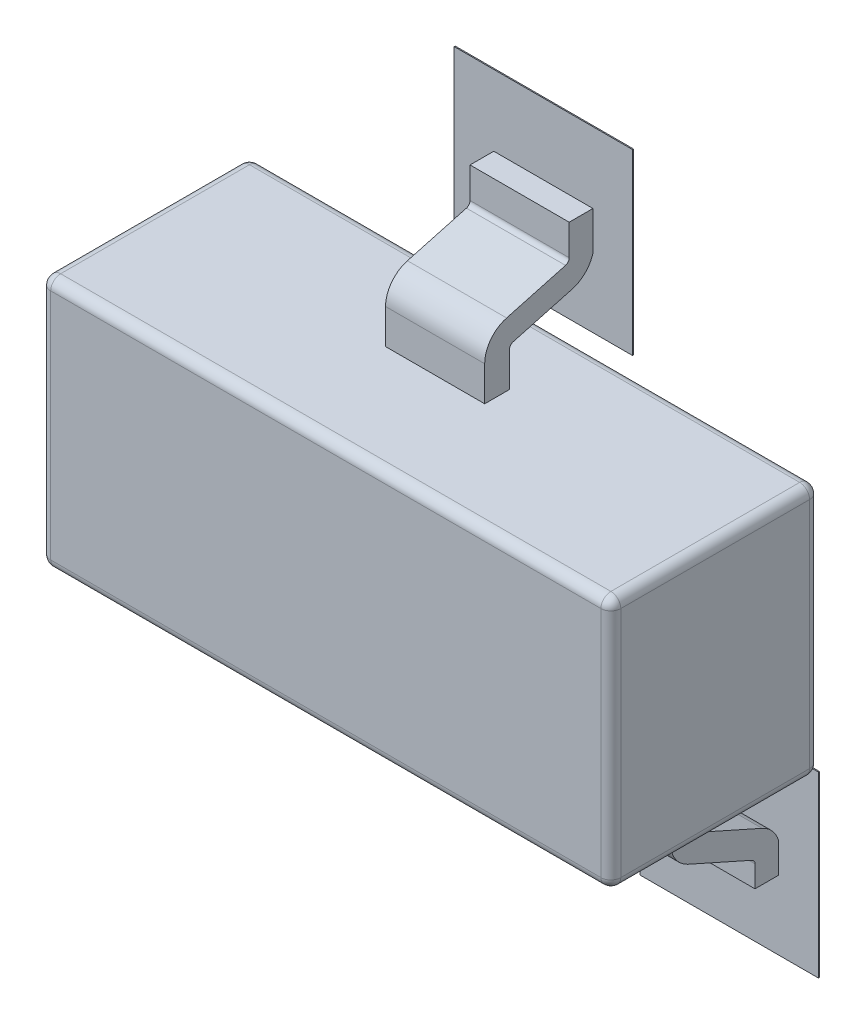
ISO-10303-21;
HEADER;
FILE_DESCRIPTION(('STEP AP214'),'2;1');
FILE_NAME('part.step','',(''),(''),'','','');
FILE_SCHEMA(('AUTOMOTIVE_DESIGN { 1 0 10303 214 1 1 1 1 }'));
ENDSEC;
DATA;
#1=APPLICATION_CONTEXT('core data for automotive mechanical design processes');
#2=APPLICATION_PROTOCOL_DEFINITION('international standard','automotive_design',2000,#1);
#3=PRODUCT_CONTEXT('',#1,'mechanical');
#4=PRODUCT('Part','Part','',(#3));
#5=PRODUCT_RELATED_PRODUCT_CATEGORY('part','',(#4));
#6=PRODUCT_DEFINITION_FORMATION('','',#4);
#7=PRODUCT_DEFINITION_CONTEXT('part definition',#1,'design');
#8=PRODUCT_DEFINITION('design','',#6,#7);
#9=PRODUCT_DEFINITION_SHAPE('','',#8);
#10=(LENGTH_UNIT() NAMED_UNIT(*) SI_UNIT(.MILLI.,.METRE.));
#11=(NAMED_UNIT(*) PLANE_ANGLE_UNIT() SI_UNIT($,.RADIAN.));
#12=(NAMED_UNIT(*) SI_UNIT($,.STERADIAN.) SOLID_ANGLE_UNIT());
#13=UNCERTAINTY_MEASURE_WITH_UNIT(LENGTH_MEASURE(1.E-05),#10,'distance_accuracy_value','');
#14=(GEOMETRIC_REPRESENTATION_CONTEXT(3) GLOBAL_UNCERTAINTY_ASSIGNED_CONTEXT((#13)) GLOBAL_UNIT_ASSIGNED_CONTEXT((#10,
#11,#12)) REPRESENTATION_CONTEXT('',''));
#15=CARTESIAN_POINT('',(0.,0.,0.));
#16=DIRECTION('',(0.,0.,1.));
#17=DIRECTION('',(1.,0.,0.));
#18=AXIS2_PLACEMENT_3D('',#15,#16,#17);
#19=CARTESIAN_POINT('',(1.205992,-1.2450064,0.0762));
#20=DIRECTION('',(0.,0.,-1.));
#21=DIRECTION('',(-1.,0.,0.));
#22=AXIS2_PLACEMENT_3D('',#19,#20,#21);
#23=PLANE('',#22);
#24=DIRECTION('',(1.,0.,0.));
#25=VECTOR('',#24,1.);
#26=CARTESIAN_POINT('',(0.4569968,1.5999968,0.0762));
#27=LINE('',#26,#25);
#28=CARTESIAN_POINT('',(0.4569968,1.5999968,0.0762));
#29=VERTEX_POINT('',#28);
#30=CARTESIAN_POINT('',(-0.4569968,1.5999968,0.0762));
#31=VERTEX_POINT('',#30);
#32=EDGE_CURVE('E717',#29,#31,#27,.F.);
#33=ORIENTED_EDGE('',*,*,#32,.F.);
#34=DIRECTION('',(0.,1.,0.));
#35=VECTOR('',#34,1.);
#36=CARTESIAN_POINT('',(0.4569968,0.6860032,0.0762));
#37=LINE('',#36,#35);
#38=CARTESIAN_POINT('',(0.4569968,0.6860032,0.0762));
#39=VERTEX_POINT('',#38);
#40=EDGE_CURVE('E698',#39,#29,#37,.T.);
#41=ORIENTED_EDGE('',*,*,#40,.F.);
#42=DIRECTION('',(1.,0.,0.));
#43=VECTOR('',#42,1.);
#44=CARTESIAN_POINT('',(-0.4569968,0.6860032,0.0762));
#45=LINE('',#44,#43);
#46=CARTESIAN_POINT('',(-0.4569968,0.6860032,0.0762));
#47=VERTEX_POINT('',#46);
#48=EDGE_CURVE('E707',#47,#39,#45,.T.);
#49=ORIENTED_EDGE('',*,*,#48,.F.);
#50=DIRECTION('',(0.,1.,0.));
#51=VECTOR('',#50,1.);
#52=CARTESIAN_POINT('',(-0.4569968,1.5999968,0.0762));
#53=LINE('',#52,#51);
#54=EDGE_CURVE('E712',#31,#47,#53,.F.);
#55=ORIENTED_EDGE('',*,*,#54,.F.);
#56=EDGE_LOOP('',(#33,#41,#49,#55));
#57=FACE_BOUND('',#56,.T.);
#58=ADVANCED_FACE('F16',(#57),#23,.T.);
#59=CARTESIAN_POINT('',(1.205992,-1.2450064,0.0762));
#60=DIRECTION('',(0.,0.,-1.));
#61=DIRECTION('',(-1.,0.,0.));
#62=AXIS2_PLACEMENT_3D('',#59,#60,#61);
#63=PLANE('',#62);
#64=DIRECTION('',(1.,0.,0.));
#65=VECTOR('',#64,1.);
#66=CARTESIAN_POINT('',(1.4089888,-0.6860032,0.0762));
#67=LINE('',#66,#65);
#68=CARTESIAN_POINT('',(1.4089888,-0.6860032,0.0762));
#69=VERTEX_POINT('',#68);
#70=CARTESIAN_POINT('',(0.4949952,-0.6860032,0.0762));
#71=VERTEX_POINT('',#70);
#72=EDGE_CURVE('E696',#69,#71,#67,.F.);
#73=ORIENTED_EDGE('',*,*,#72,.F.);
#74=DIRECTION('',(0.,1.,0.));
#75=VECTOR('',#74,1.);
#76=CARTESIAN_POINT('',(1.4089888,-1.5999968,0.0762));
#77=LINE('',#76,#75);
#78=CARTESIAN_POINT('',(1.4089888,-1.5999968,0.0762));
#79=VERTEX_POINT('',#78);
#80=EDGE_CURVE('E677',#79,#69,#77,.T.);
#81=ORIENTED_EDGE('',*,*,#80,.F.);
#82=DIRECTION('',(1.,0.,0.));
#83=VECTOR('',#82,1.);
#84=CARTESIAN_POINT('',(0.4949952,-1.5999968,0.0762));
#85=LINE('',#84,#83);
#86=CARTESIAN_POINT('',(0.4949952,-1.5999968,0.0762));
#87=VERTEX_POINT('',#86);
#88=EDGE_CURVE('E686',#87,#79,#85,.T.);
#89=ORIENTED_EDGE('',*,*,#88,.F.);
#90=DIRECTION('',(0.,1.,0.));
#91=VECTOR('',#90,1.);
#92=CARTESIAN_POINT('',(0.4949952,-0.6860032,0.0762));
#93=LINE('',#92,#91);
#94=EDGE_CURVE('E691',#71,#87,#93,.F.);
#95=ORIENTED_EDGE('',*,*,#94,.F.);
#96=EDGE_LOOP('',(#73,#81,#89,#95));
#97=FACE_BOUND('',#96,.T.);
#98=ADVANCED_FACE('F1296',(#97),#63,.T.);
#99=CARTESIAN_POINT('',(1.205992,-1.2450064,0.0762));
#100=DIRECTION('',(0.,0.,-1.));
#101=DIRECTION('',(-1.,0.,0.));
#102=AXIS2_PLACEMENT_3D('',#99,#100,#101);
#103=PLANE('',#102);
#104=DIRECTION('',(1.,0.,0.));
#105=VECTOR('',#104,1.);
#106=CARTESIAN_POINT('',(-0.4949952,-0.6860032,0.0762));
#107=LINE('',#106,#105);
#108=CARTESIAN_POINT('',(-0.4949952,-0.6860032,0.0762));
#109=VERTEX_POINT('',#108);
#110=CARTESIAN_POINT('',(-1.4089888,-0.6860032,0.0762));
#111=VERTEX_POINT('',#110);
#112=EDGE_CURVE('E675',#109,#111,#107,.F.);
#113=ORIENTED_EDGE('',*,*,#112,.F.);
#114=DIRECTION('',(0.,1.,0.));
#115=VECTOR('',#114,1.);
#116=CARTESIAN_POINT('',(-0.4949952,-1.5999968,0.0762));
#117=LINE('',#116,#115);
#118=CARTESIAN_POINT('',(-0.4949952,-1.5999968,0.0762));
#119=VERTEX_POINT('',#118);
#120=EDGE_CURVE('E646',#119,#109,#117,.T.);
#121=ORIENTED_EDGE('',*,*,#120,.F.);
#122=DIRECTION('',(1.,0.,0.));
#123=VECTOR('',#122,1.);
#124=CARTESIAN_POINT('',(-1.4089888,-1.5999968,0.0762));
#125=LINE('',#124,#123);
#126=CARTESIAN_POINT('',(-1.4089888,-1.5999968,0.0762));
#127=VERTEX_POINT('',#126);
#128=EDGE_CURVE('E665',#127,#119,#125,.T.);
#129=ORIENTED_EDGE('',*,*,#128,.F.);
#130=DIRECTION('',(0.,1.,0.));
#131=VECTOR('',#130,1.);
#132=CARTESIAN_POINT('',(-1.4089888,-0.6860032,0.0762));
#133=LINE('',#132,#131);
#134=EDGE_CURVE('E670',#111,#127,#133,.F.);
#135=ORIENTED_EDGE('',*,*,#134,.F.);
#136=EDGE_LOOP('',(#113,#121,#129,#135));
#137=FACE_BOUND('',#136,.T.);
#138=ADVANCED_FACE('F1293',(#137),#103,.T.);
#139=CARTESIAN_POINT('',(0.4569968,1.5999968,0.0762));
#140=DIRECTION('',(0.,1.,0.));
#141=DIRECTION('',(0.,0.,1.));
#142=AXIS2_PLACEMENT_3D('',#139,#140,#141);
#143=PLANE('',#142);
#144=DIRECTION('',(0.,0.,-1.));
#145=VECTOR('',#144,1.);
#146=CARTESIAN_POINT('',(0.4569968,1.5999968,0.0762));
#147=LINE('',#146,#145);
#148=CARTESIAN_POINT('',(0.4569968,1.5999968,0.081534));
#149=VERTEX_POINT('',#148);
#150=EDGE_CURVE('E704',#29,#149,#147,.F.);
#151=ORIENTED_EDGE('',*,*,#150,.F.);
#152=ORIENTED_EDGE('',*,*,#32,.T.);
#153=DIRECTION('',(0.,0.,1.));
#154=VECTOR('',#153,1.);
#155=CARTESIAN_POINT('',(-0.4569968,1.5999968,0.0762));
#156=LINE('',#155,#154);
#157=CARTESIAN_POINT('',(-0.4569968,1.5999968,0.081534));
#158=VERTEX_POINT('',#157);
#159=EDGE_CURVE('E714',#158,#31,#156,.F.);
#160=ORIENTED_EDGE('',*,*,#159,.F.);
#161=DIRECTION('',(1.,0.,0.));
#162=VECTOR('',#161,1.);
#163=CARTESIAN_POINT('',(0.,1.5999968,0.081534));
#164=LINE('',#163,#162);
#165=EDGE_CURVE('E643',#149,#158,#164,.F.);
#166=ORIENTED_EDGE('',*,*,#165,.F.);
#167=EDGE_LOOP('',(#151,#152,#160,#166));
#168=FACE_BOUND('',#167,.T.);
#169=ADVANCED_FACE('F1289',(#168),#143,.T.);
#170=CARTESIAN_POINT('',(-0.4569968,1.5999968,0.0762));
#171=DIRECTION('',(-1.,0.,0.));
#172=DIRECTION('',(0.,0.,1.));
#173=AXIS2_PLACEMENT_3D('',#170,#171,#172);
#174=PLANE('',#173);
#175=ORIENTED_EDGE('',*,*,#159,.T.);
#176=ORIENTED_EDGE('',*,*,#54,.T.);
#177=DIRECTION('',(0.,0.,-1.));
#178=VECTOR('',#177,1.);
#179=CARTESIAN_POINT('',(-0.4569968,0.6860032,0.0762));
#180=LINE('',#179,#178);
#181=CARTESIAN_POINT('',(-0.4569968,0.6860032,0.081534));
#182=VERTEX_POINT('',#181);
#183=EDGE_CURVE('E709',#182,#47,#180,.T.);
#184=ORIENTED_EDGE('',*,*,#183,.F.);
#185=DIRECTION('',(0.,1.,0.));
#186=VECTOR('',#185,1.);
#187=CARTESIAN_POINT('',(-0.4569968,0.,0.081534));
#188=LINE('',#187,#186);
#189=EDGE_CURVE('E640',#158,#182,#188,.F.);
#190=ORIENTED_EDGE('',*,*,#189,.F.);
#191=EDGE_LOOP('',(#175,#176,#184,#190));
#192=FACE_BOUND('',#191,.T.);
#193=ADVANCED_FACE('F1285',(#192),#174,.T.);
#194=CARTESIAN_POINT('',(-0.4569968,0.6860032,0.0762));
#195=DIRECTION('',(0.,-1.,0.));
#196=DIRECTION('',(0.,0.,-1.));
#197=AXIS2_PLACEMENT_3D('',#194,#195,#196);
#198=PLANE('',#197);
#199=ORIENTED_EDGE('',*,*,#183,.T.);
#200=ORIENTED_EDGE('',*,*,#48,.T.);
#201=DIRECTION('',(0.,0.,-1.));
#202=VECTOR('',#201,1.);
#203=CARTESIAN_POINT('',(0.4569968,0.6860032,0.0762));
#204=LINE('',#203,#202);
#205=CARTESIAN_POINT('',(0.4569968,0.6860032,0.081534));
#206=VERTEX_POINT('',#205);
#207=EDGE_CURVE('E701',#206,#39,#204,.T.);
#208=ORIENTED_EDGE('',*,*,#207,.F.);
#209=DIRECTION('',(1.,0.,0.));
#210=VECTOR('',#209,1.);
#211=CARTESIAN_POINT('',(0.,0.6860032,0.081534));
#212=LINE('',#211,#210);
#213=EDGE_CURVE('E637',#182,#206,#212,.T.);
#214=ORIENTED_EDGE('',*,*,#213,.F.);
#215=EDGE_LOOP('',(#199,#200,#208,#214));
#216=FACE_BOUND('',#215,.T.);
#217=ADVANCED_FACE('F1281',(#216),#198,.T.);
#218=CARTESIAN_POINT('',(0.4569968,0.6860032,0.0762));
#219=DIRECTION('',(1.,0.,0.));
#220=DIRECTION('',(0.,0.,-1.));
#221=AXIS2_PLACEMENT_3D('',#218,#219,#220);
#222=PLANE('',#221);
#223=ORIENTED_EDGE('',*,*,#207,.T.);
#224=ORIENTED_EDGE('',*,*,#40,.T.);
#225=ORIENTED_EDGE('',*,*,#150,.T.);
#226=DIRECTION('',(0.,1.,0.));
#227=VECTOR('',#226,1.);
#228=CARTESIAN_POINT('',(0.4569968,0.,0.081534));
#229=LINE('',#228,#227);
#230=EDGE_CURVE('E632',#206,#149,#229,.T.);
#231=ORIENTED_EDGE('',*,*,#230,.F.);
#232=EDGE_LOOP('',(#223,#224,#225,#231));
#233=FACE_BOUND('',#232,.T.);
#234=ADVANCED_FACE('F1277',(#233),#222,.T.);
#235=CARTESIAN_POINT('',(1.4089888,-0.6860032,0.0762));
#236=DIRECTION('',(0.,1.,0.));
#237=DIRECTION('',(0.,0.,1.));
#238=AXIS2_PLACEMENT_3D('',#235,#236,#237);
#239=PLANE('',#238);
#240=DIRECTION('',(0.,0.,-1.));
#241=VECTOR('',#240,1.);
#242=CARTESIAN_POINT('',(1.4089888,-0.6860032,0.0762));
#243=LINE('',#242,#241);
#244=CARTESIAN_POINT('',(1.4089888,-0.6860032,0.081534));
#245=VERTEX_POINT('',#244);
#246=EDGE_CURVE('E683',#69,#245,#243,.F.);
#247=ORIENTED_EDGE('',*,*,#246,.F.);
#248=ORIENTED_EDGE('',*,*,#72,.T.);
#249=DIRECTION('',(0.,0.,1.));
#250=VECTOR('',#249,1.);
#251=CARTESIAN_POINT('',(0.4949952,-0.6860032,0.0762));
#252=LINE('',#251,#250);
#253=CARTESIAN_POINT('',(0.4949952,-0.6860032,0.081534));
#254=VERTEX_POINT('',#253);
#255=EDGE_CURVE('E693',#254,#71,#252,.F.);
#256=ORIENTED_EDGE('',*,*,#255,.F.);
#257=DIRECTION('',(1.,0.,0.));
#258=VECTOR('',#257,1.);
#259=CARTESIAN_POINT('',(0.,-0.6860032,0.081534));
#260=LINE('',#259,#258);
#261=EDGE_CURVE('E1309',#245,#254,#260,.F.);
#262=ORIENTED_EDGE('',*,*,#261,.F.);
#263=EDGE_LOOP('',(#247,#248,#256,#262));
#264=FACE_BOUND('',#263,.T.);
#265=ADVANCED_FACE('F1273',(#264),#239,.T.);
#266=CARTESIAN_POINT('',(0.4949952,-0.6860032,0.0762));
#267=DIRECTION('',(-1.,0.,0.));
#268=DIRECTION('',(0.,0.,1.));
#269=AXIS2_PLACEMENT_3D('',#266,#267,#268);
#270=PLANE('',#269);
#271=ORIENTED_EDGE('',*,*,#255,.T.);
#272=ORIENTED_EDGE('',*,*,#94,.T.);
#273=DIRECTION('',(0.,0.,-1.));
#274=VECTOR('',#273,1.);
#275=CARTESIAN_POINT('',(0.4949952,-1.5999968,0.0762));
#276=LINE('',#275,#274);
#277=CARTESIAN_POINT('',(0.4949952,-1.5999968,0.081534));
#278=VERTEX_POINT('',#277);
#279=EDGE_CURVE('E688',#278,#87,#276,.T.);
#280=ORIENTED_EDGE('',*,*,#279,.F.);
#281=DIRECTION('',(0.,1.,0.));
#282=VECTOR('',#281,1.);
#283=CARTESIAN_POINT('',(0.4949952,0.,0.081534));
#284=LINE('',#283,#282);
#285=EDGE_CURVE('E1318',#254,#278,#284,.F.);
#286=ORIENTED_EDGE('',*,*,#285,.F.);
#287=EDGE_LOOP('',(#271,#272,#280,#286));
#288=FACE_BOUND('',#287,.T.);
#289=ADVANCED_FACE('F1269',(#288),#270,.T.);
#290=CARTESIAN_POINT('',(0.4949952,-1.5999968,0.0762));
#291=DIRECTION('',(0.,-1.,0.));
#292=DIRECTION('',(0.,0.,-1.));
#293=AXIS2_PLACEMENT_3D('',#290,#291,#292);
#294=PLANE('',#293);
#295=ORIENTED_EDGE('',*,*,#279,.T.);
#296=ORIENTED_EDGE('',*,*,#88,.T.);
#297=DIRECTION('',(0.,0.,-1.));
#298=VECTOR('',#297,1.);
#299=CARTESIAN_POINT('',(1.4089888,-1.5999968,0.0762));
#300=LINE('',#299,#298);
#301=CARTESIAN_POINT('',(1.4089888,-1.5999968,0.081534));
#302=VERTEX_POINT('',#301);
#303=EDGE_CURVE('E680',#302,#79,#300,.T.);
#304=ORIENTED_EDGE('',*,*,#303,.F.);
#305=DIRECTION('',(1.,0.,0.));
#306=VECTOR('',#305,1.);
#307=CARTESIAN_POINT('',(0.,-1.5999968,0.081534));
#308=LINE('',#307,#306);
#309=EDGE_CURVE('E1315',#278,#302,#308,.T.);
#310=ORIENTED_EDGE('',*,*,#309,.F.);
#311=EDGE_LOOP('',(#295,#296,#304,#310));
#312=FACE_BOUND('',#311,.T.);
#313=ADVANCED_FACE('F1265',(#312),#294,.T.);
#314=CARTESIAN_POINT('',(1.4089888,-1.5999968,0.0762));
#315=DIRECTION('',(1.,0.,0.));
#316=DIRECTION('',(0.,0.,-1.));
#317=AXIS2_PLACEMENT_3D('',#314,#315,#316);
#318=PLANE('',#317);
#319=ORIENTED_EDGE('',*,*,#303,.T.);
#320=ORIENTED_EDGE('',*,*,#80,.T.);
#321=ORIENTED_EDGE('',*,*,#246,.T.);
#322=DIRECTION('',(0.,1.,0.));
#323=VECTOR('',#322,1.);
#324=CARTESIAN_POINT('',(1.4089888,0.,0.081534));
#325=LINE('',#324,#323);
#326=EDGE_CURVE('E1312',#302,#245,#325,.T.);
#327=ORIENTED_EDGE('',*,*,#326,.F.);
#328=EDGE_LOOP('',(#319,#320,#321,#327));
#329=FACE_BOUND('',#328,.T.);
#330=ADVANCED_FACE('F1261',(#329),#318,.T.);
#331=CARTESIAN_POINT('',(-0.4949952,-0.6860032,0.0762));
#332=DIRECTION('',(0.,1.,0.));
#333=DIRECTION('',(0.,0.,1.));
#334=AXIS2_PLACEMENT_3D('',#331,#332,#333);
#335=PLANE('',#334);
#336=DIRECTION('',(0.,0.,-1.));
#337=VECTOR('',#336,1.);
#338=CARTESIAN_POINT('',(-0.4949952,-0.6860032,0.0762));
#339=LINE('',#338,#337);
#340=CARTESIAN_POINT('',(-0.4949952,-0.6860032,0.081534));
#341=VERTEX_POINT('',#340);
#342=EDGE_CURVE('E662',#109,#341,#339,.F.);
#343=ORIENTED_EDGE('',*,*,#342,.F.);
#344=ORIENTED_EDGE('',*,*,#112,.T.);
#345=DIRECTION('',(0.,0.,1.));
#346=VECTOR('',#345,1.);
#347=CARTESIAN_POINT('',(-1.4089888,-0.6860032,0.0762));
#348=LINE('',#347,#346);
#349=CARTESIAN_POINT('',(-1.4089888,-0.6860032,0.081534));
#350=VERTEX_POINT('',#349);
#351=EDGE_CURVE('E672',#350,#111,#348,.F.);
#352=ORIENTED_EDGE('',*,*,#351,.F.);
#353=DIRECTION('',(1.,0.,0.));
#354=VECTOR('',#353,1.);
#355=CARTESIAN_POINT('',(0.,-0.6860032,0.081534));
#356=LINE('',#355,#354);
#357=EDGE_CURVE('E1331',#341,#350,#356,.F.);
#358=ORIENTED_EDGE('',*,*,#357,.F.);
#359=EDGE_LOOP('',(#343,#344,#352,#358));
#360=FACE_BOUND('',#359,.T.);
#361=ADVANCED_FACE('F1257',(#360),#335,.T.);
#362=CARTESIAN_POINT('',(-1.4089888,-0.6860032,0.0762));
#363=DIRECTION('',(-1.,0.,0.));
#364=DIRECTION('',(0.,0.,1.));
#365=AXIS2_PLACEMENT_3D('',#362,#363,#364);
#366=PLANE('',#365);
#367=ORIENTED_EDGE('',*,*,#351,.T.);
#368=ORIENTED_EDGE('',*,*,#134,.T.);
#369=DIRECTION('',(0.,0.,-1.));
#370=VECTOR('',#369,1.);
#371=CARTESIAN_POINT('',(-1.4089888,-1.5999968,0.0762));
#372=LINE('',#371,#370);
#373=CARTESIAN_POINT('',(-1.4089888,-1.5999968,0.081534));
#374=VERTEX_POINT('',#373);
#375=EDGE_CURVE('E667',#374,#127,#372,.T.);
#376=ORIENTED_EDGE('',*,*,#375,.F.);
#377=DIRECTION('',(0.,1.,0.));
#378=VECTOR('',#377,1.);
#379=CARTESIAN_POINT('',(-1.4089888,0.,0.081534));
#380=LINE('',#379,#378);
#381=EDGE_CURVE('E1431',#350,#374,#380,.F.);
#382=ORIENTED_EDGE('',*,*,#381,.F.);
#383=EDGE_LOOP('',(#367,#368,#376,#382));
#384=FACE_BOUND('',#383,.T.);
#385=ADVANCED_FACE('F1254',(#384),#366,.T.);
#386=CARTESIAN_POINT('',(-1.4089888,-1.5999968,0.0762));
#387=DIRECTION('',(0.,-1.,0.));
#388=DIRECTION('',(0.,0.,-1.));
#389=AXIS2_PLACEMENT_3D('',#386,#387,#388);
#390=PLANE('',#389);
#391=ORIENTED_EDGE('',*,*,#375,.T.);
#392=ORIENTED_EDGE('',*,*,#128,.T.);
#393=DIRECTION('',(0.,0.,-1.));
#394=VECTOR('',#393,1.);
#395=CARTESIAN_POINT('',(-0.4949952,-1.5999968,0.0762));
#396=LINE('',#395,#394);
#397=CARTESIAN_POINT('',(-0.4949952,-1.5999968,0.081534));
#398=VERTEX_POINT('',#397);
#399=EDGE_CURVE('E60',#398,#119,#396,.T.);
#400=ORIENTED_EDGE('',*,*,#399,.F.);
#401=DIRECTION('',(1.,0.,0.));
#402=VECTOR('',#401,1.);
#403=CARTESIAN_POINT('',(0.,-1.5999968,0.081534));
#404=LINE('',#403,#402);
#405=EDGE_CURVE('E1428',#374,#398,#404,.T.);
#406=ORIENTED_EDGE('',*,*,#405,.F.);
#407=EDGE_LOOP('',(#391,#392,#400,#406));
#408=FACE_BOUND('',#407,.T.);
#409=ADVANCED_FACE('F1250',(#408),#390,.T.);
#410=CARTESIAN_POINT('',(-0.4949952,-1.5999968,0.0762));
#411=DIRECTION('',(1.,0.,0.));
#412=DIRECTION('',(0.,0.,-1.));
#413=AXIS2_PLACEMENT_3D('',#410,#411,#412);
#414=PLANE('',#413);
#415=ORIENTED_EDGE('',*,*,#399,.T.);
#416=ORIENTED_EDGE('',*,*,#120,.T.);
#417=ORIENTED_EDGE('',*,*,#342,.T.);
#418=DIRECTION('',(0.,1.,0.));
#419=VECTOR('',#418,1.);
#420=CARTESIAN_POINT('',(-0.4949952,0.,0.081534));
#421=LINE('',#420,#419);
#422=EDGE_CURVE('E1425',#398,#341,#421,.T.);
#423=ORIENTED_EDGE('',*,*,#422,.F.);
#424=EDGE_LOOP('',(#415,#416,#417,#423));
#425=FACE_BOUND('',#424,.T.);
#426=ADVANCED_FACE('F1246',(#425),#414,.T.);
#427=CARTESIAN_POINT('',(0.,0.,0.081534));
#428=DIRECTION('',(0.,0.,1.));
#429=DIRECTION('',(1.,0.,0.));
#430=AXIS2_PLACEMENT_3D('',#427,#428,#429);
#431=PLANE('',#430);
#432=DIRECTION('',(1.,0.,0.));
#433=VECTOR('',#432,1.);
#434=CARTESIAN_POINT('',(-0.254,1.03945842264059,0.0815339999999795));
#435=LINE('',#434,#433);
#436=CARTESIAN_POINT('',(-0.254,1.03945842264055,0.0815339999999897));
#437=VERTEX_POINT('',#436);
#438=CARTESIAN_POINT('',(0.254,1.03945842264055,0.0815339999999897));
#439=VERTEX_POINT('',#438);
#440=EDGE_CURVE('E579',#437,#439,#435,.T.);
#441=ORIENTED_EDGE('',*,*,#440,.F.);
#442=DIRECTION('',(0.,1.,0.));
#443=VECTOR('',#442,1.);
#444=CARTESIAN_POINT('',(-0.254,0.,0.081534));
#445=LINE('',#444,#443);
#446=CARTESIAN_POINT('',(-0.254,1.23720111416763,0.081534));
#447=VERTEX_POINT('',#446);
#448=EDGE_CURVE('E611',#437,#447,#445,.T.);
#449=ORIENTED_EDGE('',*,*,#448,.T.);
#450=DIRECTION('',(1.,0.,0.));
#451=VECTOR('',#450,1.);
#452=CARTESIAN_POINT('',(-0.254,1.23720111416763,0.081534));
#453=LINE('',#452,#451);
#454=CARTESIAN_POINT('',(0.254,1.23720111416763,0.081534));
#455=VERTEX_POINT('',#454);
#456=EDGE_CURVE('E622',#455,#447,#453,.F.);
#457=ORIENTED_EDGE('',*,*,#456,.F.);
#458=DIRECTION('',(0.,1.,0.));
#459=VECTOR('',#458,1.);
#460=CARTESIAN_POINT('',(0.254,0.,0.081534));
#461=LINE('',#460,#459);
#462=EDGE_CURVE('E649',#439,#455,#461,.T.);
#463=ORIENTED_EDGE('',*,*,#462,.F.);
#464=EDGE_LOOP('',(#441,#449,#457,#463));
#465=FACE_BOUND('',#464,.T.);
#466=ORIENTED_EDGE('',*,*,#213,.T.);
#467=ORIENTED_EDGE('',*,*,#230,.T.);
#468=ORIENTED_EDGE('',*,*,#165,.T.);
#469=ORIENTED_EDGE('',*,*,#189,.T.);
#470=EDGE_LOOP('',(#466,#467,#468,#469));
#471=FACE_BOUND('',#470,.T.);
#472=ADVANCED_FACE('F1242',(#465,#471),#431,.T.);
#473=CARTESIAN_POINT('',(-0.254,1.23720111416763,0.0762));
#474=DIRECTION('',(0.,1.,0.));
#475=DIRECTION('',(0.,0.,1.));
#476=AXIS2_PLACEMENT_3D('',#473,#474,#475);
#477=PLANE('',#476);
#478=DIRECTION('',(0.,0.,-1.));
#479=VECTOR('',#478,1.);
#480=CARTESIAN_POINT('',(0.254,1.23720111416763,0.));
#481=LINE('',#480,#479);
#482=CARTESIAN_POINT('',(0.254,1.23720111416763,0.2032));
#483=VERTEX_POINT('',#482);
#484=EDGE_CURVE('E450',#455,#483,#481,.F.);
#485=ORIENTED_EDGE('',*,*,#484,.F.);
#486=ORIENTED_EDGE('',*,*,#456,.T.);
#487=DIRECTION('',(0.,0.,-1.));
#488=VECTOR('',#487,1.);
#489=CARTESIAN_POINT('',(-0.254,1.23720111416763,0.));
#490=LINE('',#489,#488);
#491=CARTESIAN_POINT('',(-0.254,1.23720111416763,0.2032));
#492=VERTEX_POINT('',#491);
#493=EDGE_CURVE('E625',#447,#492,#490,.F.);
#494=ORIENTED_EDGE('',*,*,#493,.T.);
#495=DIRECTION('',(1.,0.,0.));
#496=VECTOR('',#495,1.);
#497=CARTESIAN_POINT('',(-0.254,1.23720111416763,0.2032));
#498=LINE('',#497,#496);
#499=EDGE_CURVE('E619',#483,#492,#498,.F.);
#500=ORIENTED_EDGE('',*,*,#499,.F.);
#501=EDGE_LOOP('',(#485,#486,#494,#500));
#502=FACE_BOUND('',#501,.T.);
#503=ADVANCED_FACE('F1239',(#502),#477,.T.);
#504=CARTESIAN_POINT('',(-0.254,1.23720111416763,0.2032));
#505=DIRECTION('',(0.,0.,1.));
#506=DIRECTION('',(1.,0.,0.));
#507=AXIS2_PLACEMENT_3D('',#504,#505,#506);
#508=PLANE('',#507);
#509=ORIENTED_EDGE('',*,*,#499,.T.);
#510=DIRECTION('',(0.,1.,0.));
#511=VECTOR('',#510,1.);
#512=CARTESIAN_POINT('',(-0.254,0.,0.2032));
#513=LINE('',#512,#511);
#514=CARTESIAN_POINT('',(-0.254,1.07942530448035,0.2032));
#515=VERTEX_POINT('',#514);
#516=EDGE_CURVE('E627',#492,#515,#513,.F.);
#517=ORIENTED_EDGE('',*,*,#516,.T.);
#518=DIRECTION('',(1.,0.,0.));
#519=VECTOR('',#518,1.);
#520=CARTESIAN_POINT('',(-0.254,1.07942530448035,0.2032));
#521=LINE('',#520,#519);
#522=CARTESIAN_POINT('',(0.254,1.07942530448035,0.2032));
#523=VERTEX_POINT('',#522);
#524=EDGE_CURVE('E420',#515,#523,#521,.T.);
#525=ORIENTED_EDGE('',*,*,#524,.T.);
#526=DIRECTION('',(0.,1.,0.));
#527=VECTOR('',#526,1.);
#528=CARTESIAN_POINT('',(0.254,0.,0.2032));
#529=LINE('',#528,#527);
#530=EDGE_CURVE('E448',#483,#523,#529,.F.);
#531=ORIENTED_EDGE('',*,*,#530,.F.);
#532=EDGE_LOOP('',(#509,#517,#525,#531));
#533=FACE_BOUND('',#532,.T.);
#534=ADVANCED_FACE('F1236',(#533),#508,.T.);
#535=CARTESIAN_POINT('',(-0.254,1.07942530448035,0.2286));
#536=DIRECTION('',(1.,0.,0.));
#537=DIRECTION('',(0.,0.,-1.));
#538=AXIS2_PLACEMENT_3D('',#535,#536,#537);
#539=CYLINDRICAL_SURFACE('',#538,0.0254);
#540=CARTESIAN_POINT('',(0.254,1.07942530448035,0.2286));
#541=DIRECTION('',(1.,0.,0.));
#542=DIRECTION('',(0.,0.,-1.));
#543=AXIS2_PLACEMENT_3D('',#540,#541,#542);
#544=CIRCLE('',#543,0.0254);
#545=CARTESIAN_POINT('',(0.254,1.05492127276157,0.221913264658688));
#546=VERTEX_POINT('',#545);
#547=EDGE_CURVE('E429',#523,#546,#544,.F.);
#548=ORIENTED_EDGE('',*,*,#547,.F.);
#549=ORIENTED_EDGE('',*,*,#524,.F.);
#550=CARTESIAN_POINT('',(-0.254,1.07942530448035,0.2286));
#551=DIRECTION('',(1.,0.,0.));
#552=DIRECTION('',(0.,0.,-1.));
#553=AXIS2_PLACEMENT_3D('',#550,#551,#552);
#554=CIRCLE('',#553,0.0254);
#555=CARTESIAN_POINT('',(-0.254,1.05492127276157,0.221913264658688));
#556=VERTEX_POINT('',#555);
#557=EDGE_CURVE('E432',#515,#556,#554,.F.);
#558=ORIENTED_EDGE('',*,*,#557,.T.);
#559=DIRECTION('',(1.,0.,0.));
#560=VECTOR('',#559,1.);
#561=CARTESIAN_POINT('',(-0.254,1.05492127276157,0.221913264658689));
#562=LINE('',#561,#560);
#563=EDGE_CURVE('E425',#546,#556,#562,.F.);
#564=ORIENTED_EDGE('',*,*,#563,.F.);
#565=EDGE_LOOP('',(#548,#549,#558,#564));
#566=FACE_BOUND('',#565,.T.);
#567=ADVANCED_FACE('F427',(#566),#539,.F.);
#568=CARTESIAN_POINT('',(-0.254,1.05492127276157,0.221913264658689));
#569=DIRECTION('',(0.,0.964725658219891,0.263257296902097));
#570=DIRECTION('',(0.,-0.263257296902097,0.964725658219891));
#571=AXIS2_PLACEMENT_3D('',#568,#569,#570);
#572=PLANE('',#571);
#573=ORIENTED_EDGE('',*,*,#563,.T.);
#574=DIRECTION('',(0.,-0.263257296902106,0.964725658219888));
#575=VECTOR('',#574,1.);
#576=CARTESIAN_POINT('',(-0.254,1.05492127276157,0.221913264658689));
#577=LINE('',#576,#575);
#578=CARTESIAN_POINT('',(-0.254,0.972524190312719,0.523863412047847));
#579=VERTEX_POINT('',#578);
#580=EDGE_CURVE('E870',#556,#579,#577,.T.);
#581=ORIENTED_EDGE('',*,*,#580,.T.);
#582=DIRECTION('',(1.,0.,0.));
#583=VECTOR('',#582,1.);
#584=CARTESIAN_POINT('',(-0.254,0.972524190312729,0.523863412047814));
#585=LINE('',#584,#583);
#586=CARTESIAN_POINT('',(0.254,0.972524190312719,0.523863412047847));
#587=VERTEX_POINT('',#586);
#588=EDGE_CURVE('E435',#587,#579,#585,.F.);
#589=ORIENTED_EDGE('',*,*,#588,.F.);
#590=DIRECTION('',(0.,-0.263257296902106,0.964725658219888));
#591=VECTOR('',#590,1.);
#592=CARTESIAN_POINT('',(0.254,1.05492127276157,0.221913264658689));
#593=LINE('',#592,#591);
#594=EDGE_CURVE('E438',#546,#587,#593,.T.);
#595=ORIENTED_EDGE('',*,*,#594,.F.);
#596=EDGE_LOOP('',(#573,#581,#589,#595));
#597=FACE_BOUND('',#596,.T.);
#598=ADVANCED_FACE('F439',(#597),#572,.T.);
#599=CARTESIAN_POINT('',(-0.254,0.8255,0.483743));
#600=DIRECTION('',(1.,0.,0.));
#601=DIRECTION('',(0.,0.,-1.));
#602=AXIS2_PLACEMENT_3D('',#599,#600,#601);
#603=CYLINDRICAL_SURFACE('',#602,0.1524);
#604=ORIENTED_EDGE('',*,*,#588,.T.);
#605=CARTESIAN_POINT('',(-0.254,0.8255,0.483743));
#606=DIRECTION('',(1.,0.,0.));
#607=DIRECTION('',(0.,0.,-1.));
#608=AXIS2_PLACEMENT_3D('',#605,#606,#607);
#609=CIRCLE('',#608,0.1524);
#610=CARTESIAN_POINT('',(-0.254,0.8255,0.636143));
#611=VERTEX_POINT('',#610);
#612=EDGE_CURVE('E867',#579,#611,#609,.T.);
#613=ORIENTED_EDGE('',*,*,#612,.T.);
#614=DIRECTION('',(1.,0.,0.));
#615=VECTOR('',#614,1.);
#616=CARTESIAN_POINT('',(-0.254,0.8255,0.636143));
#617=LINE('',#616,#615);
#618=CARTESIAN_POINT('',(0.254,0.8255,0.636143));
#619=VERTEX_POINT('',#618);
#620=EDGE_CURVE('E608',#619,#611,#617,.F.);
#621=ORIENTED_EDGE('',*,*,#620,.F.);
#622=CARTESIAN_POINT('',(0.254,0.8255,0.483743));
#623=DIRECTION('',(1.,0.,0.));
#624=DIRECTION('',(0.,0.,-1.));
#625=AXIS2_PLACEMENT_3D('',#622,#623,#624);
#626=CIRCLE('',#625,0.1524);
#627=EDGE_CURVE('E443',#587,#619,#626,.T.);
#628=ORIENTED_EDGE('',*,*,#627,.F.);
#629=EDGE_LOOP('',(#604,#613,#621,#628));
#630=FACE_BOUND('',#629,.T.);
#631=ADVANCED_FACE('F1227',(#630),#603,.T.);
#632=CARTESIAN_POINT('',(-0.254,0.8255,0.483743));
#633=DIRECTION('',(1.,0.,0.));
#634=DIRECTION('',(0.,0.,-1.));
#635=AXIS2_PLACEMENT_3D('',#632,#633,#634);
#636=CYLINDRICAL_SURFACE('',#635,0.0254);
#637=CARTESIAN_POINT('',(0.254,0.8255,0.483743));
#638=DIRECTION('',(1.,0.,0.));
#639=DIRECTION('',(0.,0.,-1.));
#640=AXIS2_PLACEMENT_3D('',#637,#638,#639);
#641=CIRCLE('',#640,0.0254);
#642=CARTESIAN_POINT('',(0.254,0.8255,0.509143));
#643=VERTEX_POINT('',#642);
#644=CARTESIAN_POINT('',(0.254,0.850004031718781,0.490429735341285));
#645=VERTEX_POINT('',#644);
#646=EDGE_CURVE('E874',#643,#645,#641,.F.);
#647=ORIENTED_EDGE('',*,*,#646,.F.);
#648=DIRECTION('',(-1.,0.,0.));
#649=VECTOR('',#648,1.);
#650=CARTESIAN_POINT('',(-0.254,0.8255,0.509143));
#651=LINE('',#650,#649);
#652=CARTESIAN_POINT('',(-0.254,0.8255,0.509143));
#653=VERTEX_POINT('',#652);
#654=EDGE_CURVE('E458',#653,#643,#651,.F.);
#655=ORIENTED_EDGE('',*,*,#654,.F.);
#656=CARTESIAN_POINT('',(-0.254,0.8255,0.483743));
#657=DIRECTION('',(1.,0.,0.));
#658=DIRECTION('',(0.,0.,-1.));
#659=AXIS2_PLACEMENT_3D('',#656,#657,#658);
#660=CIRCLE('',#659,0.0254);
#661=CARTESIAN_POINT('',(-0.254,0.850004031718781,0.490429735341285));
#662=VERTEX_POINT('',#661);
#663=EDGE_CURVE('E864',#653,#662,#660,.F.);
#664=ORIENTED_EDGE('',*,*,#663,.T.);
#665=DIRECTION('',(1.,0.,0.));
#666=VECTOR('',#665,1.);
#667=CARTESIAN_POINT('',(-0.254,0.850004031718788,0.49042973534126));
#668=LINE('',#667,#666);
#669=EDGE_CURVE('E589',#645,#662,#668,.F.);
#670=ORIENTED_EDGE('',*,*,#669,.F.);
#671=EDGE_LOOP('',(#647,#655,#664,#670));
#672=FACE_BOUND('',#671,.T.);
#673=ADVANCED_FACE('F1221',(#672),#636,.F.);
#674=CARTESIAN_POINT('',(-0.254,0.850004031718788,0.49042973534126));
#675=DIRECTION('',(0.,-0.964725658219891,-0.263257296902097));
#676=DIRECTION('',(0.,0.263257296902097,-0.964725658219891));
#677=AXIS2_PLACEMENT_3D('',#674,#675,#676);
#678=PLANE('',#677);
#679=ORIENTED_EDGE('',*,*,#669,.T.);
#680=DIRECTION('',(0.,0.263257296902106,-0.964725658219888));
#681=VECTOR('',#680,1.);
#682=CARTESIAN_POINT('',(-0.254,0.850004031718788,0.49042973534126));
#683=LINE('',#682,#681);
#684=CARTESIAN_POINT('',(-0.254,0.932401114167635,0.188479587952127));
#685=VERTEX_POINT('',#684);
#686=EDGE_CURVE('E863',#662,#685,#683,.T.);
#687=ORIENTED_EDGE('',*,*,#686,.T.);
#688=DIRECTION('',(1.,0.,0.));
#689=VECTOR('',#688,1.);
#690=CARTESIAN_POINT('',(-0.254,0.932401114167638,0.188479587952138));
#691=LINE('',#690,#689);
#692=CARTESIAN_POINT('',(0.254,0.932401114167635,0.188479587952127));
#693=VERTEX_POINT('',#692);
#694=EDGE_CURVE('E586',#693,#685,#691,.F.);
#695=ORIENTED_EDGE('',*,*,#694,.F.);
#696=DIRECTION('',(0.,0.263257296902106,-0.964725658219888));
#697=VECTOR('',#696,1.);
#698=CARTESIAN_POINT('',(0.254,0.850004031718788,0.49042973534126));
#699=LINE('',#698,#697);
#700=EDGE_CURVE('E873',#645,#693,#699,.T.);
#701=ORIENTED_EDGE('',*,*,#700,.F.);
#702=EDGE_LOOP('',(#679,#687,#695,#701));
#703=FACE_BOUND('',#702,.T.);
#704=ADVANCED_FACE('F1216',(#703),#678,.T.);
#705=CARTESIAN_POINT('',(-0.254,1.07942530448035,0.2286));
#706=DIRECTION('',(1.,0.,0.));
#707=DIRECTION('',(0.,0.,-1.));
#708=AXIS2_PLACEMENT_3D('',#705,#706,#707);
#709=CYLINDRICAL_SURFACE('',#708,0.1524);
#710=CARTESIAN_POINT('',(-0.254,1.07942530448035,0.2286));
#711=DIRECTION('',(1.,0.,0.));
#712=DIRECTION('',(0.,0.,-1.));
#713=AXIS2_PLACEMENT_3D('',#710,#711,#712);
#714=CIRCLE('',#713,0.1524);
#715=EDGE_CURVE('E860',#685,#437,#714,.T.);
#716=ORIENTED_EDGE('',*,*,#715,.T.);
#717=ORIENTED_EDGE('',*,*,#440,.T.);
#718=CARTESIAN_POINT('',(0.254,1.07942530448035,0.2286));
#719=DIRECTION('',(1.,0.,0.));
#720=DIRECTION('',(0.,0.,-1.));
#721=AXIS2_PLACEMENT_3D('',#718,#719,#720);
#722=CIRCLE('',#721,0.1524);
#723=EDGE_CURVE('E872',#693,#439,#722,.T.);
#724=ORIENTED_EDGE('',*,*,#723,.F.);
#725=ORIENTED_EDGE('',*,*,#694,.T.);
#726=EDGE_LOOP('',(#716,#717,#724,#725));
#727=FACE_BOUND('',#726,.T.);
#728=ADVANCED_FACE('F1212',(#727),#709,.T.);
#729=CARTESIAN_POINT('',(-1.4097,0.5969,0.1778));
#730=DIRECTION('',(-0.707106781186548,0.,-0.707106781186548));
#731=DIRECTION('',(0.,1.,0.));
#732=AXIS2_PLACEMENT_3D('',#729,#730,#731);
#733=SPHERICAL_SURFACE('',#732,0.0508);
#734=CARTESIAN_POINT('',(-1.4097,0.5969,0.1778));
#735=DIRECTION('',(0.,-1.,0.));
#736=DIRECTION('',(0.,0.,-1.));
#737=AXIS2_PLACEMENT_3D('',#734,#735,#736);
#738=CIRCLE('',#737,0.0508);
#739=CARTESIAN_POINT('',(-1.4605,0.5969,0.1778));
#740=VERTEX_POINT('',#739);
#741=CARTESIAN_POINT('',(-1.44562102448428,0.5969,0.141878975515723));
#742=VERTEX_POINT('',#741);
#743=EDGE_CURVE('E856',#740,#742,#738,.T.);
#744=ORIENTED_EDGE('',*,*,#743,.F.);
#745=CARTESIAN_POINT('',(-1.4097,0.5969,0.1778));
#746=DIRECTION('',(0.,0.,-1.));
#747=DIRECTION('',(-1.,0.,0.));
#748=AXIS2_PLACEMENT_3D('',#745,#746,#747);
#749=CIRCLE('',#748,0.0508);
#750=CARTESIAN_POINT('',(-1.4097,0.6477,0.1778));
#751=VERTEX_POINT('',#750);
#752=EDGE_CURVE('E857',#751,#740,#749,.F.);
#753=ORIENTED_EDGE('',*,*,#752,.F.);
#754=CARTESIAN_POINT('',(-1.4097,0.5969,0.1778));
#755=DIRECTION('',(-1.,0.,0.));
#756=DIRECTION('',(0.,0.,1.));
#757=AXIS2_PLACEMENT_3D('',#754,#755,#756);
#758=CIRCLE('',#757,0.0508);
#759=CARTESIAN_POINT('',(-1.4097,0.5969,0.127));
#760=VERTEX_POINT('',#759);
#761=EDGE_CURVE('E19',#760,#751,#758,.F.);
#762=ORIENTED_EDGE('',*,*,#761,.F.);
#763=CARTESIAN_POINT('',(-1.4097,0.5969,0.1778));
#764=DIRECTION('',(0.,-1.,0.));
#765=DIRECTION('',(0.,0.,-1.));
#766=AXIS2_PLACEMENT_3D('',#763,#764,#765);
#767=CIRCLE('',#766,0.0508);
#768=EDGE_CURVE('E583',#742,#760,#767,.T.);
#769=ORIENTED_EDGE('',*,*,#768,.F.);
#770=EDGE_LOOP('',(#744,#753,#762,#769));
#771=FACE_BOUND('',#770,.T.);
#772=ADVANCED_FACE('F562',(#771),#733,.T.);
#773=CARTESIAN_POINT('',(-1.4097,-0.5969,0.1778));
#774=DIRECTION('',(0.,-0.707106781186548,-0.707106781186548));
#775=DIRECTION('',(-1.,0.,0.));
#776=AXIS2_PLACEMENT_3D('',#773,#774,#775);
#777=SPHERICAL_SURFACE('',#776,0.0508);
#778=CARTESIAN_POINT('',(-1.4097,-0.5969,0.1778));
#779=DIRECTION('',(1.,0.,0.));
#780=DIRECTION('',(0.,0.,-1.));
#781=AXIS2_PLACEMENT_3D('',#778,#779,#780);
#782=CIRCLE('',#781,0.0508);
#783=CARTESIAN_POINT('',(-1.4097,-0.632821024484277,0.141878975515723));
#784=VERTEX_POINT('',#783);
#785=CARTESIAN_POINT('',(-1.4097,-0.5969,0.127));
#786=VERTEX_POINT('',#785);
#787=EDGE_CURVE('E575',#784,#786,#782,.T.);
#788=ORIENTED_EDGE('',*,*,#787,.F.);
#789=CARTESIAN_POINT('',(-1.4097,-0.5969,0.1778));
#790=DIRECTION('',(1.,0.,0.));
#791=DIRECTION('',(0.,0.,-1.));
#792=AXIS2_PLACEMENT_3D('',#789,#790,#791);
#793=CIRCLE('',#792,0.0508);
#794=CARTESIAN_POINT('',(-1.4097,-0.6477,0.1778));
#795=VERTEX_POINT('',#794);
#796=EDGE_CURVE('E846',#795,#784,#793,.T.);
#797=ORIENTED_EDGE('',*,*,#796,.F.);
#798=CARTESIAN_POINT('',(-1.4097,-0.5969,0.1778));
#799=DIRECTION('',(0.,0.,-1.));
#800=DIRECTION('',(-1.,0.,0.));
#801=AXIS2_PLACEMENT_3D('',#798,#799,#800);
#802=CIRCLE('',#801,0.0508);
#803=CARTESIAN_POINT('',(-1.4605,-0.5969,0.1778));
#804=VERTEX_POINT('',#803);
#805=EDGE_CURVE('E850',#804,#795,#802,.F.);
#806=ORIENTED_EDGE('',*,*,#805,.F.);
#807=CARTESIAN_POINT('',(-1.4097,-0.5969,0.1778));
#808=DIRECTION('',(0.,-1.,0.));
#809=DIRECTION('',(0.,0.,-1.));
#810=AXIS2_PLACEMENT_3D('',#807,#808,#809);
#811=CIRCLE('',#810,0.0508);
#812=EDGE_CURVE('E582',#786,#804,#811,.F.);
#813=ORIENTED_EDGE('',*,*,#812,.F.);
#814=EDGE_LOOP('',(#788,#797,#806,#813));
#815=FACE_BOUND('',#814,.T.);
#816=ADVANCED_FACE('F557',(#815),#777,.T.);
#817=CARTESIAN_POINT('',(0.,0.,0.127));
#818=DIRECTION('',(0.,0.,1.));
#819=DIRECTION('',(1.,0.,0.));
#820=AXIS2_PLACEMENT_3D('',#817,#818,#819);
#821=PLANE('',#820);
#822=DIRECTION('',(0.,1.,0.));
#823=VECTOR('',#822,1.);
#824=CARTESIAN_POINT('',(1.4097,0.,0.127));
#825=LINE('',#824,#823);
#826=CARTESIAN_POINT('',(1.4097,-0.5969,0.127));
#827=VERTEX_POINT('',#826);
#828=CARTESIAN_POINT('',(1.4097,0.5969,0.127));
#829=VERTEX_POINT('',#828);
#830=EDGE_CURVE('E576',#827,#829,#825,.T.);
#831=ORIENTED_EDGE('',*,*,#830,.F.);
#832=DIRECTION('',(1.,0.,0.));
#833=VECTOR('',#832,1.);
#834=CARTESIAN_POINT('',(-5.4973728,-0.5969,0.127));
#835=LINE('',#834,#833);
#836=EDGE_CURVE('E571',#786,#827,#835,.T.);
#837=ORIENTED_EDGE('',*,*,#836,.F.);
#838=DIRECTION('',(0.,-1.,0.));
#839=VECTOR('',#838,1.);
#840=CARTESIAN_POINT('',(-1.4097,5.77150845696,0.127));
#841=LINE('',#840,#839);
#842=EDGE_CURVE('E580',#760,#786,#841,.T.);
#843=ORIENTED_EDGE('',*,*,#842,.F.);
#844=DIRECTION('',(-1.,0.,0.));
#845=VECTOR('',#844,1.);
#846=CARTESIAN_POINT('',(5.4973728,0.5969,0.127));
#847=LINE('',#846,#845);
#848=EDGE_CURVE('E454',#829,#760,#847,.T.);
#849=ORIENTED_EDGE('',*,*,#848,.F.);
#850=EDGE_LOOP('',(#831,#837,#843,#849));
#851=FACE_BOUND('',#850,.T.);
#852=ADVANCED_FACE('F553',(#851),#821,.F.);
#853=CARTESIAN_POINT('',(1.205992,-1.13399741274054,0.2286));
#854=DIRECTION('',(1.,0.,0.));
#855=DIRECTION('',(0.,0.,-1.));
#856=AXIS2_PLACEMENT_3D('',#853,#854,#855);
#857=CYLINDRICAL_SURFACE('',#856,0.1524);
#858=CARTESIAN_POINT('',(1.205992,-1.13399741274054,0.2286));
#859=DIRECTION('',(1.,0.,0.));
#860=DIRECTION('',(0.,0.,-1.));
#861=AXIS2_PLACEMENT_3D('',#858,#859,#860);
#862=CIRCLE('',#861,0.1524);
#863=CARTESIAN_POINT('',(1.205992,-1.09403053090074,0.081534));
#864=VERTEX_POINT('',#863);
#865=CARTESIAN_POINT('',(1.205992,-0.994816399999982,0.166516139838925));
#866=VERTEX_POINT('',#865);
#867=EDGE_CURVE('E827',#864,#866,#862,.T.);
#868=ORIENTED_EDGE('',*,*,#867,.F.);
#869=DIRECTION('',(1.,0.,0.));
#870=VECTOR('',#869,1.);
#871=CARTESIAN_POINT('',(0.,-1.09403053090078,0.081534));
#872=LINE('',#871,#870);
#873=CARTESIAN_POINT('',(0.697992,-1.09403053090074,0.081534));
#874=VERTEX_POINT('',#873);
#875=EDGE_CURVE('E1328',#874,#864,#872,.T.);
#876=ORIENTED_EDGE('',*,*,#875,.F.);
#877=CARTESIAN_POINT('',(0.697992,-1.13399741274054,0.2286));
#878=DIRECTION('',(1.,0.,0.));
#879=DIRECTION('',(0.,0.,-1.));
#880=AXIS2_PLACEMENT_3D('',#877,#878,#879);
#881=CIRCLE('',#880,0.1524);
#882=CARTESIAN_POINT('',(0.697992,-0.994816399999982,0.166516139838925));
#883=VERTEX_POINT('',#882);
#884=EDGE_CURVE('E841',#874,#883,#881,.T.);
#885=ORIENTED_EDGE('',*,*,#884,.T.);
#886=DIRECTION('',(1.,0.,0.));
#887=VECTOR('',#886,1.);
#888=CARTESIAN_POINT('',(1.205992,-0.9948164,0.166516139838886));
#889=LINE('',#888,#887);
#890=EDGE_CURVE('E578',#866,#883,#889,.F.);
#891=ORIENTED_EDGE('',*,*,#890,.F.);
#892=EDGE_LOOP('',(#868,#876,#885,#891));
#893=FACE_BOUND('',#892,.T.);
#894=ADVANCED_FACE('F549',(#893),#857,.T.);
#895=CARTESIAN_POINT('',(1.205992,-0.9948164,0.166516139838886));
#896=DIRECTION('',(0.,0.913261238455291,-0.407374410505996));
#897=DIRECTION('',(0.,0.407374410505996,0.913261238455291));
#898=AXIS2_PLACEMENT_3D('',#895,#896,#897);
#899=PLANE('',#898);
#900=DIRECTION('',(1.,0.,0.));
#901=VECTOR('',#900,1.);
#902=CARTESIAN_POINT('',(1.205992,-0.848696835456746,0.494090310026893));
#903=LINE('',#902,#901);
#904=CARTESIAN_POINT('',(0.697992,-0.848696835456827,0.494090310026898));
#905=VERTEX_POINT('',#904);
#906=CARTESIAN_POINT('',(1.205992,-0.848696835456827,0.494090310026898));
#907=VERTEX_POINT('',#906);
#908=EDGE_CURVE('E1349',#905,#907,#903,.T.);
#909=ORIENTED_EDGE('',*,*,#908,.T.);
#910=DIRECTION('',(0.,0.407374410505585,0.913261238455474));
#911=VECTOR('',#910,1.);
#912=CARTESIAN_POINT('',(1.205992,-0.9948164,0.166516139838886));
#913=LINE('',#912,#911);
#914=EDGE_CURVE('E826',#866,#907,#913,.T.);
#915=ORIENTED_EDGE('',*,*,#914,.F.);
#916=ORIENTED_EDGE('',*,*,#890,.T.);
#917=DIRECTION('',(0.,0.407374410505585,0.913261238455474));
#918=VECTOR('',#917,1.);
#919=CARTESIAN_POINT('',(0.697992,-0.9948164,0.166516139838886));
#920=LINE('',#919,#918);
#921=EDGE_CURVE('E840',#883,#905,#920,.T.);
#922=ORIENTED_EDGE('',*,*,#921,.T.);
#923=EDGE_LOOP('',(#909,#915,#916,#922));
#924=FACE_BOUND('',#923,.T.);
#925=ADVANCED_FACE('F545',(#924),#899,.T.);
#926=CARTESIAN_POINT('',(1.205992,-0.8255,0.483743));
#927=DIRECTION('',(1.,0.,0.));
#928=DIRECTION('',(0.,0.,-1.));
#929=AXIS2_PLACEMENT_3D('',#926,#927,#928);
#930=CYLINDRICAL_SURFACE('',#929,0.0254);
#931=CARTESIAN_POINT('',(0.697992,-0.8255,0.483743));
#932=DIRECTION('',(1.,0.,0.));
#933=DIRECTION('',(0.,0.,-1.));
#934=AXIS2_PLACEMENT_3D('',#931,#932,#933);
#935=CIRCLE('',#934,0.0254);
#936=CARTESIAN_POINT('',(0.697992,-0.8255,0.509143));
#937=VERTEX_POINT('',#936);
#938=EDGE_CURVE('E838',#905,#937,#935,.F.);
#939=ORIENTED_EDGE('',*,*,#938,.T.);
#940=DIRECTION('',(-1.,0.,0.));
#941=VECTOR('',#940,1.);
#942=CARTESIAN_POINT('',(1.205992,-0.8255,0.509143));
#943=LINE('',#942,#941);
#944=CARTESIAN_POINT('',(1.205992,-0.8255,0.509143));
#945=VERTEX_POINT('',#944);
#946=EDGE_CURVE('E574',#945,#937,#943,.T.);
#947=ORIENTED_EDGE('',*,*,#946,.F.);
#948=CARTESIAN_POINT('',(1.205992,-0.8255,0.483743));
#949=DIRECTION('',(1.,0.,0.));
#950=DIRECTION('',(0.,0.,-1.));
#951=AXIS2_PLACEMENT_3D('',#948,#949,#950);
#952=CIRCLE('',#951,0.0254);
#953=EDGE_CURVE('E822',#907,#945,#952,.F.);
#954=ORIENTED_EDGE('',*,*,#953,.F.);
#955=ORIENTED_EDGE('',*,*,#908,.F.);
#956=EDGE_LOOP('',(#939,#947,#954,#955));
#957=FACE_BOUND('',#956,.T.);
#958=ADVANCED_FACE('F541',(#957),#930,.F.);
#959=CARTESIAN_POINT('',(1.205992,-0.8255,0.483743));
#960=DIRECTION('',(1.,0.,0.));
#961=DIRECTION('',(0.,0.,-1.));
#962=AXIS2_PLACEMENT_3D('',#959,#960,#961);
#963=CYLINDRICAL_SURFACE('',#962,0.1524);
#964=DIRECTION('',(1.,0.,0.));
#965=VECTOR('',#964,1.);
#966=CARTESIAN_POINT('',(1.205992,-0.964681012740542,0.545826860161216));
#967=LINE('',#966,#965);
#968=CARTESIAN_POINT('',(1.205992,-0.964681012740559,0.545826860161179));
#969=VERTEX_POINT('',#968);
#970=CARTESIAN_POINT('',(0.697992,-0.964681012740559,0.545826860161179));
#971=VERTEX_POINT('',#970);
#972=EDGE_CURVE('E1346',#969,#971,#967,.F.);
#973=ORIENTED_EDGE('',*,*,#972,.F.);
#974=CARTESIAN_POINT('',(1.205992,-0.8255,0.483743));
#975=DIRECTION('',(1.,0.,0.));
#976=DIRECTION('',(0.,0.,-1.));
#977=AXIS2_PLACEMENT_3D('',#974,#975,#976);
#978=CIRCLE('',#977,0.1524);
#979=CARTESIAN_POINT('',(1.205992,-0.8255,0.636143));
#980=VERTEX_POINT('',#979);
#981=EDGE_CURVE('E818',#980,#969,#978,.T.);
#982=ORIENTED_EDGE('',*,*,#981,.F.);
#983=DIRECTION('',(1.,0.,0.));
#984=VECTOR('',#983,1.);
#985=CARTESIAN_POINT('',(1.205992,-0.8255,0.636143));
#986=LINE('',#985,#984);
#987=CARTESIAN_POINT('',(0.697992,-0.8255,0.636143));
#988=VERTEX_POINT('',#987);
#989=EDGE_CURVE('E830',#988,#980,#986,.T.);
#990=ORIENTED_EDGE('',*,*,#989,.F.);
#991=CARTESIAN_POINT('',(0.697992,-0.8255,0.483743));
#992=DIRECTION('',(1.,0.,0.));
#993=DIRECTION('',(0.,0.,-1.));
#994=AXIS2_PLACEMENT_3D('',#991,#992,#993);
#995=CIRCLE('',#994,0.1524);
#996=EDGE_CURVE('E835',#988,#971,#995,.T.);
#997=ORIENTED_EDGE('',*,*,#996,.T.);
#998=EDGE_LOOP('',(#973,#982,#990,#997));
#999=FACE_BOUND('',#998,.T.);
#1000=ADVANCED_FACE('F537',(#999),#963,.T.);
#1001=CARTESIAN_POINT('',(1.205992,-0.964681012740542,0.545826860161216));
#1002=DIRECTION('',(0.,-0.913261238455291,0.407374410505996));
#1003=DIRECTION('',(0.,-0.407374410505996,-0.913261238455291));
#1004=AXIS2_PLACEMENT_3D('',#1001,#1002,#1003);
#1005=PLANE('',#1004);
#1006=DIRECTION('',(1.,0.,0.));
#1007=VECTOR('',#1006,1.);
#1008=CARTESIAN_POINT('',(1.205992,-1.1108005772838,0.218252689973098));
#1009=LINE('',#1008,#1007);
#1010=CARTESIAN_POINT('',(0.697992,-1.11080057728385,0.218252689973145));
#1011=VERTEX_POINT('',#1010);
#1012=CARTESIAN_POINT('',(1.205992,-1.11080057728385,0.218252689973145));
#1013=VERTEX_POINT('',#1012);
#1014=EDGE_CURVE('E1344',#1011,#1013,#1009,.T.);
#1015=ORIENTED_EDGE('',*,*,#1014,.T.);
#1016=DIRECTION('',(0.,-0.407374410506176,-0.913261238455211));
#1017=VECTOR('',#1016,1.);
#1018=CARTESIAN_POINT('',(1.205992,-0.964681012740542,0.545826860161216));
#1019=LINE('',#1018,#1017);
#1020=EDGE_CURVE('E817',#969,#1013,#1019,.T.);
#1021=ORIENTED_EDGE('',*,*,#1020,.F.);
#1022=ORIENTED_EDGE('',*,*,#972,.T.);
#1023=DIRECTION('',(0.,-0.407374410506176,-0.913261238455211));
#1024=VECTOR('',#1023,1.);
#1025=CARTESIAN_POINT('',(0.697992,-0.964681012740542,0.545826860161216));
#1026=LINE('',#1025,#1024);
#1027=EDGE_CURVE('E834',#971,#1011,#1026,.T.);
#1028=ORIENTED_EDGE('',*,*,#1027,.T.);
#1029=EDGE_LOOP('',(#1015,#1021,#1022,#1028));
#1030=FACE_BOUND('',#1029,.T.);
#1031=ADVANCED_FACE('F533',(#1030),#1005,.T.);
#1032=CARTESIAN_POINT('',(1.205992,-1.13399741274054,0.2286));
#1033=DIRECTION('',(1.,0.,0.));
#1034=DIRECTION('',(0.,0.,-1.));
#1035=AXIS2_PLACEMENT_3D('',#1032,#1033,#1034);
#1036=CYLINDRICAL_SURFACE('',#1035,0.0254);
#1037=CARTESIAN_POINT('',(0.697992,-1.13399741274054,0.2286));
#1038=DIRECTION('',(1.,0.,0.));
#1039=DIRECTION('',(0.,0.,-1.));
#1040=AXIS2_PLACEMENT_3D('',#1037,#1038,#1039);
#1041=CIRCLE('',#1040,0.0254);
#1042=CARTESIAN_POINT('',(0.697992,-1.13399741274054,0.2032));
#1043=VERTEX_POINT('',#1042);
#1044=EDGE_CURVE('E831',#1011,#1043,#1041,.F.);
#1045=ORIENTED_EDGE('',*,*,#1044,.T.);
#1046=DIRECTION('',(1.,0.,0.));
#1047=VECTOR('',#1046,1.);
#1048=CARTESIAN_POINT('',(1.205992,-1.13399741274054,0.2032));
#1049=LINE('',#1048,#1047);
#1050=CARTESIAN_POINT('',(1.205992,-1.13399741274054,0.2032));
#1051=VERTEX_POINT('',#1050);
#1052=EDGE_CURVE('E1324',#1051,#1043,#1049,.F.);
#1053=ORIENTED_EDGE('',*,*,#1052,.F.);
#1054=CARTESIAN_POINT('',(1.205992,-1.13399741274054,0.2286));
#1055=DIRECTION('',(1.,0.,0.));
#1056=DIRECTION('',(0.,0.,-1.));
#1057=AXIS2_PLACEMENT_3D('',#1054,#1055,#1056);
#1058=CIRCLE('',#1057,0.0254);
#1059=EDGE_CURVE('E813',#1013,#1051,#1058,.F.);
#1060=ORIENTED_EDGE('',*,*,#1059,.F.);
#1061=ORIENTED_EDGE('',*,*,#1014,.F.);
#1062=EDGE_LOOP('',(#1045,#1053,#1060,#1061));
#1063=FACE_BOUND('',#1062,.T.);
#1064=ADVANCED_FACE('F529',(#1063),#1036,.F.);
#1065=CARTESIAN_POINT('',(1.205992,-1.13399741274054,0.2032));
#1066=DIRECTION('',(0.,0.,1.));
#1067=DIRECTION('',(1.,0.,0.));
#1068=AXIS2_PLACEMENT_3D('',#1065,#1066,#1067);
#1069=PLANE('',#1068);
#1070=DIRECTION('',(1.,0.,0.));
#1071=VECTOR('',#1070,1.);
#1072=CARTESIAN_POINT('',(1.205992,-1.2450064,0.2032));
#1073=LINE('',#1072,#1071);
#1074=CARTESIAN_POINT('',(1.205992,-1.2450064,0.2032));
#1075=VERTEX_POINT('',#1074);
#1076=CARTESIAN_POINT('',(0.697992,-1.2450064,0.2032));
#1077=VERTEX_POINT('',#1076);
#1078=EDGE_CURVE('E1321',#1075,#1077,#1073,.F.);
#1079=ORIENTED_EDGE('',*,*,#1078,.F.);
#1080=DIRECTION('',(0.,1.,0.));
#1081=VECTOR('',#1080,1.);
#1082=CARTESIAN_POINT('',(1.205992,0.,0.2032));
#1083=LINE('',#1082,#1081);
#1084=EDGE_CURVE('E816',#1051,#1075,#1083,.F.);
#1085=ORIENTED_EDGE('',*,*,#1084,.F.);
#1086=ORIENTED_EDGE('',*,*,#1052,.T.);
#1087=DIRECTION('',(0.,1.,0.));
#1088=VECTOR('',#1087,1.);
#1089=CARTESIAN_POINT('',(0.697992,0.,0.2032));
#1090=LINE('',#1089,#1088);
#1091=EDGE_CURVE('E833',#1043,#1077,#1090,.F.);
#1092=ORIENTED_EDGE('',*,*,#1091,.T.);
#1093=EDGE_LOOP('',(#1079,#1085,#1086,#1092));
#1094=FACE_BOUND('',#1093,.T.);
#1095=ADVANCED_FACE('F525',(#1094),#1069,.T.);
#1096=CARTESIAN_POINT('',(1.205992,-1.2450064,0.2032));
#1097=DIRECTION('',(0.,-1.,0.));
#1098=DIRECTION('',(0.,0.,-1.));
#1099=AXIS2_PLACEMENT_3D('',#1096,#1097,#1098);
#1100=PLANE('',#1099);
#1101=DIRECTION('',(0.,0.,-1.));
#1102=VECTOR('',#1101,1.);
#1103=CARTESIAN_POINT('',(0.697992,-1.2450064,0.));
#1104=LINE('',#1103,#1102);
#1105=CARTESIAN_POINT('',(0.697992,-1.2450064,0.081534));
#1106=VERTEX_POINT('',#1105);
#1107=EDGE_CURVE('E930',#1077,#1106,#1104,.T.);
#1108=ORIENTED_EDGE('',*,*,#1107,.T.);
#1109=DIRECTION('',(1.,0.,0.));
#1110=VECTOR('',#1109,1.);
#1111=CARTESIAN_POINT('',(0.,-1.2450064,0.081534));
#1112=LINE('',#1111,#1110);
#1113=CARTESIAN_POINT('',(1.205992,-1.2450064,0.081534));
#1114=VERTEX_POINT('',#1113);
#1115=EDGE_CURVE('E1332',#1114,#1106,#1112,.F.);
#1116=ORIENTED_EDGE('',*,*,#1115,.F.);
#1117=DIRECTION('',(0.,0.,-1.));
#1118=VECTOR('',#1117,1.);
#1119=CARTESIAN_POINT('',(1.205992,-1.2450064,0.));
#1120=LINE('',#1119,#1118);
#1121=EDGE_CURVE('E947',#1075,#1114,#1120,.T.);
#1122=ORIENTED_EDGE('',*,*,#1121,.F.);
#1123=ORIENTED_EDGE('',*,*,#1078,.T.);
#1124=EDGE_LOOP('',(#1108,#1116,#1122,#1123));
#1125=FACE_BOUND('',#1124,.T.);
#1126=ADVANCED_FACE('F521',(#1125),#1100,.T.);
#1127=CARTESIAN_POINT('',(0.,0.,0.081534));
#1128=DIRECTION('',(0.,0.,1.));
#1129=DIRECTION('',(1.,0.,0.));
#1130=AXIS2_PLACEMENT_3D('',#1127,#1128,#1129);
#1131=PLANE('',#1130);
#1132=ORIENTED_EDGE('',*,*,#875,.T.);
#1133=DIRECTION('',(0.,1.,0.));
#1134=VECTOR('',#1133,1.);
#1135=CARTESIAN_POINT('',(1.205992,0.,0.081534));
#1136=LINE('',#1135,#1134);
#1137=EDGE_CURVE('E950',#1114,#864,#1136,.T.);
#1138=ORIENTED_EDGE('',*,*,#1137,.F.);
#1139=ORIENTED_EDGE('',*,*,#1115,.T.);
#1140=DIRECTION('',(0.,1.,0.));
#1141=VECTOR('',#1140,1.);
#1142=CARTESIAN_POINT('',(0.697992,0.,0.081534));
#1143=LINE('',#1142,#1141);
#1144=EDGE_CURVE('E843',#1106,#874,#1143,.T.);
#1145=ORIENTED_EDGE('',*,*,#1144,.T.);
#1146=EDGE_LOOP('',(#1132,#1138,#1139,#1145));
#1147=FACE_BOUND('',#1146,.T.);
#1148=ORIENTED_EDGE('',*,*,#309,.T.);
#1149=ORIENTED_EDGE('',*,*,#326,.T.);
#1150=ORIENTED_EDGE('',*,*,#261,.T.);
#1151=ORIENTED_EDGE('',*,*,#285,.T.);
#1152=EDGE_LOOP('',(#1148,#1149,#1150,#1151));
#1153=FACE_BOUND('',#1152,.T.);
#1154=ADVANCED_FACE('F517',(#1147,#1153),#1131,.T.);
#1155=CARTESIAN_POINT('',(0.,0.,0.081534));
#1156=DIRECTION('',(0.,0.,1.));
#1157=DIRECTION('',(1.,0.,0.));
#1158=AXIS2_PLACEMENT_3D('',#1155,#1156,#1157);
#1159=PLANE('',#1158);
#1160=DIRECTION('',(1.,0.,0.));
#1161=VECTOR('',#1160,1.);
#1162=CARTESIAN_POINT('',(-1.205992,-1.2450064,0.081534));
#1163=LINE('',#1162,#1161);
#1164=CARTESIAN_POINT('',(-0.697992,-1.2450064,0.081534));
#1165=VERTEX_POINT('',#1164);
#1166=CARTESIAN_POINT('',(-1.205992,-1.2450064,0.081534));
#1167=VERTEX_POINT('',#1166);
#1168=EDGE_CURVE('E1436',#1165,#1167,#1163,.F.);
#1169=ORIENTED_EDGE('',*,*,#1168,.T.);
#1170=DIRECTION('',(0.,1.,0.));
#1171=VECTOR('',#1170,1.);
#1172=CARTESIAN_POINT('',(-1.205992,0.,0.081534));
#1173=LINE('',#1172,#1171);
#1174=CARTESIAN_POINT('',(-1.205992,-1.09403053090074,0.0815339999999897));
#1175=VERTEX_POINT('',#1174);
#1176=EDGE_CURVE('E795',#1167,#1175,#1173,.T.);
#1177=ORIENTED_EDGE('',*,*,#1176,.T.);
#1178=DIRECTION('',(1.,0.,0.));
#1179=VECTOR('',#1178,1.);
#1180=CARTESIAN_POINT('',(-1.205992,-1.09403053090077,0.0815339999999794));
#1181=LINE('',#1180,#1179);
#1182=CARTESIAN_POINT('',(-0.697992,-1.09403053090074,0.0815339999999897));
#1183=VERTEX_POINT('',#1182);
#1184=EDGE_CURVE('E1422',#1183,#1175,#1181,.F.);
#1185=ORIENTED_EDGE('',*,*,#1184,.F.);
#1186=DIRECTION('',(0.,1.,0.));
#1187=VECTOR('',#1186,1.);
#1188=CARTESIAN_POINT('',(-0.697992,0.,0.081534));
#1189=LINE('',#1188,#1187);
#1190=EDGE_CURVE('E968',#1165,#1183,#1189,.T.);
#1191=ORIENTED_EDGE('',*,*,#1190,.F.);
#1192=EDGE_LOOP('',(#1169,#1177,#1185,#1191));
#1193=FACE_BOUND('',#1192,.T.);
#1194=ORIENTED_EDGE('',*,*,#405,.T.);
#1195=ORIENTED_EDGE('',*,*,#422,.T.);
#1196=ORIENTED_EDGE('',*,*,#357,.T.);
#1197=ORIENTED_EDGE('',*,*,#381,.T.);
#1198=EDGE_LOOP('',(#1194,#1195,#1196,#1197));
#1199=FACE_BOUND('',#1198,.T.);
#1200=ADVANCED_FACE('F513',(#1193,#1199),#1159,.T.);
#1201=CARTESIAN_POINT('',(-1.205992,-1.13399741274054,0.2286));
#1202=DIRECTION('',(1.,0.,0.));
#1203=DIRECTION('',(0.,0.,-1.));
#1204=AXIS2_PLACEMENT_3D('',#1201,#1202,#1203);
#1205=CYLINDRICAL_SURFACE('',#1204,0.1524);
#1206=CARTESIAN_POINT('',(-0.697992,-1.13399741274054,0.2286));
#1207=DIRECTION('',(1.,0.,0.));
#1208=DIRECTION('',(0.,0.,-1.));
#1209=AXIS2_PLACEMENT_3D('',#1206,#1207,#1208);
#1210=CIRCLE('',#1209,0.1524);
#1211=CARTESIAN_POINT('',(-0.697992,-0.994816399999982,0.166516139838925));
#1212=VERTEX_POINT('',#1211);
#1213=EDGE_CURVE('E809',#1183,#1212,#1210,.T.);
#1214=ORIENTED_EDGE('',*,*,#1213,.F.);
#1215=ORIENTED_EDGE('',*,*,#1184,.T.);
#1216=CARTESIAN_POINT('',(-1.205992,-1.13399741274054,0.2286));
#1217=DIRECTION('',(1.,0.,0.));
#1218=DIRECTION('',(0.,0.,-1.));
#1219=AXIS2_PLACEMENT_3D('',#1216,#1217,#1218);
#1220=CIRCLE('',#1219,0.1524);
#1221=CARTESIAN_POINT('',(-1.205992,-0.994816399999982,0.166516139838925));
#1222=VERTEX_POINT('',#1221);
#1223=EDGE_CURVE('E793',#1175,#1222,#1220,.T.);
#1224=ORIENTED_EDGE('',*,*,#1223,.T.);
#1225=DIRECTION('',(1.,0.,0.));
#1226=VECTOR('',#1225,1.);
#1227=CARTESIAN_POINT('',(-1.205992,-0.9948164,0.166516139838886));
#1228=LINE('',#1227,#1226);
#1229=EDGE_CURVE('E1420',#1222,#1212,#1228,.T.);
#1230=ORIENTED_EDGE('',*,*,#1229,.T.);
#1231=EDGE_LOOP('',(#1214,#1215,#1224,#1230));
#1232=FACE_BOUND('',#1231,.T.);
#1233=ADVANCED_FACE('F509',(#1232),#1205,.T.);
#1234=CARTESIAN_POINT('',(-1.205992,-0.9948164,0.166516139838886));
#1235=DIRECTION('',(0.,-0.913261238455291,0.407374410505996));
#1236=DIRECTION('',(0.,-0.407374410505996,-0.913261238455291));
#1237=AXIS2_PLACEMENT_3D('',#1234,#1235,#1236);
#1238=PLANE('',#1237);
#1239=DIRECTION('',(0.,0.407374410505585,0.913261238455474));
#1240=VECTOR('',#1239,1.);
#1241=CARTESIAN_POINT('',(-0.697992,-0.9948164,0.166516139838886));
#1242=LINE('',#1241,#1240);
#1243=CARTESIAN_POINT('',(-0.697992,-0.848696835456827,0.494090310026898));
#1244=VERTEX_POINT('',#1243);
#1245=EDGE_CURVE('E808',#1212,#1244,#1242,.T.);
#1246=ORIENTED_EDGE('',*,*,#1245,.F.);
#1247=ORIENTED_EDGE('',*,*,#1229,.F.);
#1248=DIRECTION('',(0.,0.407374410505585,0.913261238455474));
#1249=VECTOR('',#1248,1.);
#1250=CARTESIAN_POINT('',(-1.205992,-0.9948164,0.166516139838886));
#1251=LINE('',#1250,#1249);
#1252=CARTESIAN_POINT('',(-1.205992,-0.848696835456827,0.494090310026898));
#1253=VERTEX_POINT('',#1252);
#1254=EDGE_CURVE('E792',#1222,#1253,#1251,.T.);
#1255=ORIENTED_EDGE('',*,*,#1254,.T.);
#1256=DIRECTION('',(1.,0.,0.));
#1257=VECTOR('',#1256,1.);
#1258=CARTESIAN_POINT('',(-1.205992,-0.848696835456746,0.494090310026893));
#1259=LINE('',#1258,#1257);
#1260=EDGE_CURVE('E1417',#1253,#1244,#1259,.T.);
#1261=ORIENTED_EDGE('',*,*,#1260,.T.);
#1262=EDGE_LOOP('',(#1246,#1247,#1255,#1261));
#1263=FACE_BOUND('',#1262,.T.);
#1264=ADVANCED_FACE('F505',(#1263),#1238,.F.);
#1265=CARTESIAN_POINT('',(-1.205992,-0.8255,0.483743));
#1266=DIRECTION('',(1.,0.,0.));
#1267=DIRECTION('',(0.,0.,-1.));
#1268=AXIS2_PLACEMENT_3D('',#1265,#1266,#1267);
#1269=CYLINDRICAL_SURFACE('',#1268,0.0254);
#1270=CARTESIAN_POINT('',(-0.697992,-0.8255,0.483743));
#1271=DIRECTION('',(1.,0.,0.));
#1272=DIRECTION('',(0.,0.,-1.));
#1273=AXIS2_PLACEMENT_3D('',#1270,#1271,#1272);
#1274=CIRCLE('',#1273,0.0254);
#1275=CARTESIAN_POINT('',(-0.697992,-0.8255,0.509143));
#1276=VERTEX_POINT('',#1275);
#1277=EDGE_CURVE('E805',#1244,#1276,#1274,.F.);
#1278=ORIENTED_EDGE('',*,*,#1277,.F.);
#1279=ORIENTED_EDGE('',*,*,#1260,.F.);
#1280=CARTESIAN_POINT('',(-1.205992,-0.8255,0.483743));
#1281=DIRECTION('',(1.,0.,0.));
#1282=DIRECTION('',(0.,0.,-1.));
#1283=AXIS2_PLACEMENT_3D('',#1280,#1281,#1282);
#1284=CIRCLE('',#1283,0.0254);
#1285=CARTESIAN_POINT('',(-1.205992,-0.8255,0.509143));
#1286=VERTEX_POINT('',#1285);
#1287=EDGE_CURVE('E789',#1253,#1286,#1284,.F.);
#1288=ORIENTED_EDGE('',*,*,#1287,.T.);
#1289=DIRECTION('',(1.,0.,0.));
#1290=VECTOR('',#1289,1.);
#1291=CARTESIAN_POINT('',(-1.205992,-0.8255,0.509143));
#1292=LINE('',#1291,#1290);
#1293=EDGE_CURVE('E971',#1286,#1276,#1292,.T.);
#1294=ORIENTED_EDGE('',*,*,#1293,.T.);
#1295=EDGE_LOOP('',(#1278,#1279,#1288,#1294));
#1296=FACE_BOUND('',#1295,.T.);
#1297=ADVANCED_FACE('F501',(#1296),#1269,.F.);
#1298=CARTESIAN_POINT('',(-1.205992,-0.8255,0.483743));
#1299=DIRECTION('',(1.,0.,0.));
#1300=DIRECTION('',(0.,0.,-1.));
#1301=AXIS2_PLACEMENT_3D('',#1298,#1299,#1300);
#1302=CYLINDRICAL_SURFACE('',#1301,0.1524);
#1303=DIRECTION('',(-1.,0.,0.));
#1304=VECTOR('',#1303,1.);
#1305=CARTESIAN_POINT('',(-1.205992,-0.8255,0.636143));
#1306=LINE('',#1305,#1304);
#1307=CARTESIAN_POINT('',(-0.697992,-0.8255,0.636143));
#1308=VERTEX_POINT('',#1307);
#1309=CARTESIAN_POINT('',(-1.205992,-0.8255,0.636143));
#1310=VERTEX_POINT('',#1309);
#1311=EDGE_CURVE('E812',#1308,#1310,#1306,.T.);
#1312=ORIENTED_EDGE('',*,*,#1311,.T.);
#1313=CARTESIAN_POINT('',(-1.205992,-0.8255,0.483743));
#1314=DIRECTION('',(1.,0.,0.));
#1315=DIRECTION('',(0.,0.,-1.));
#1316=AXIS2_PLACEMENT_3D('',#1313,#1314,#1315);
#1317=CIRCLE('',#1316,0.1524);
#1318=CARTESIAN_POINT('',(-1.205992,-0.964681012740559,0.545826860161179));
#1319=VERTEX_POINT('',#1318);
#1320=EDGE_CURVE('E786',#1310,#1319,#1317,.T.);
#1321=ORIENTED_EDGE('',*,*,#1320,.T.);
#1322=DIRECTION('',(1.,0.,0.));
#1323=VECTOR('',#1322,1.);
#1324=CARTESIAN_POINT('',(-1.205992,-0.964681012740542,0.545826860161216));
#1325=LINE('',#1324,#1323);
#1326=CARTESIAN_POINT('',(-0.697992,-0.964681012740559,0.545826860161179));
#1327=VERTEX_POINT('',#1326);
#1328=EDGE_CURVE('E1419',#1319,#1327,#1325,.T.);
#1329=ORIENTED_EDGE('',*,*,#1328,.T.);
#1330=CARTESIAN_POINT('',(-0.697992,-0.8255,0.483743));
#1331=DIRECTION('',(1.,0.,0.));
#1332=DIRECTION('',(0.,0.,-1.));
#1333=AXIS2_PLACEMENT_3D('',#1330,#1331,#1332);
#1334=CIRCLE('',#1333,0.1524);
#1335=EDGE_CURVE('E801',#1308,#1327,#1334,.T.);
#1336=ORIENTED_EDGE('',*,*,#1335,.F.);
#1337=EDGE_LOOP('',(#1312,#1321,#1329,#1336));
#1338=FACE_BOUND('',#1337,.T.);
#1339=ADVANCED_FACE('F497',(#1338),#1302,.T.);
#1340=CARTESIAN_POINT('',(-1.205992,-0.964681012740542,0.545826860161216));
#1341=DIRECTION('',(0.,0.913261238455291,-0.407374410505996));
#1342=DIRECTION('',(0.,0.407374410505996,0.913261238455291));
#1343=AXIS2_PLACEMENT_3D('',#1340,#1341,#1342);
#1344=PLANE('',#1343);
#1345=DIRECTION('',(0.,-0.407374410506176,-0.913261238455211));
#1346=VECTOR('',#1345,1.);
#1347=CARTESIAN_POINT('',(-0.697992,-0.964681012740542,0.545826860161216));
#1348=LINE('',#1347,#1346);
#1349=CARTESIAN_POINT('',(-0.697992,-1.11080057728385,0.218252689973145));
#1350=VERTEX_POINT('',#1349);
#1351=EDGE_CURVE('E800',#1327,#1350,#1348,.T.);
#1352=ORIENTED_EDGE('',*,*,#1351,.F.);
#1353=ORIENTED_EDGE('',*,*,#1328,.F.);
#1354=DIRECTION('',(0.,-0.407374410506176,-0.913261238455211));
#1355=VECTOR('',#1354,1.);
#1356=CARTESIAN_POINT('',(-1.205992,-0.964681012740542,0.545826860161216));
#1357=LINE('',#1356,#1355);
#1358=CARTESIAN_POINT('',(-1.205992,-1.11080057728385,0.218252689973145));
#1359=VERTEX_POINT('',#1358);
#1360=EDGE_CURVE('E785',#1319,#1359,#1357,.T.);
#1361=ORIENTED_EDGE('',*,*,#1360,.T.);
#1362=DIRECTION('',(1.,0.,0.));
#1363=VECTOR('',#1362,1.);
#1364=CARTESIAN_POINT('',(-1.205992,-1.1108005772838,0.218252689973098));
#1365=LINE('',#1364,#1363);
#1366=EDGE_CURVE('E1478',#1359,#1350,#1365,.T.);
#1367=ORIENTED_EDGE('',*,*,#1366,.T.);
#1368=EDGE_LOOP('',(#1352,#1353,#1361,#1367));
#1369=FACE_BOUND('',#1368,.T.);
#1370=ADVANCED_FACE('F493',(#1369),#1344,.F.);
#1371=CARTESIAN_POINT('',(-1.205992,-1.13399741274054,0.2286));
#1372=DIRECTION('',(1.,0.,0.));
#1373=DIRECTION('',(0.,0.,-1.));
#1374=AXIS2_PLACEMENT_3D('',#1371,#1372,#1373);
#1375=CYLINDRICAL_SURFACE('',#1374,0.0254);
#1376=CARTESIAN_POINT('',(-0.697992,-1.13399741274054,0.2286));
#1377=DIRECTION('',(1.,0.,0.));
#1378=DIRECTION('',(0.,0.,-1.));
#1379=AXIS2_PLACEMENT_3D('',#1376,#1377,#1378);
#1380=CIRCLE('',#1379,0.0254);
#1381=CARTESIAN_POINT('',(-0.697992,-1.13399741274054,0.2032));
#1382=VERTEX_POINT('',#1381);
#1383=EDGE_CURVE('E796',#1350,#1382,#1380,.F.);
#1384=ORIENTED_EDGE('',*,*,#1383,.F.);
#1385=ORIENTED_EDGE('',*,*,#1366,.F.);
#1386=CARTESIAN_POINT('',(-1.205992,-1.13399741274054,0.2286));
#1387=DIRECTION('',(1.,0.,0.));
#1388=DIRECTION('',(0.,0.,-1.));
#1389=AXIS2_PLACEMENT_3D('',#1386,#1387,#1388);
#1390=CIRCLE('',#1389,0.0254);
#1391=CARTESIAN_POINT('',(-1.205992,-1.13399741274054,0.2032));
#1392=VERTEX_POINT('',#1391);
#1393=EDGE_CURVE('E782',#1359,#1392,#1390,.F.);
#1394=ORIENTED_EDGE('',*,*,#1393,.T.);
#1395=DIRECTION('',(-1.,0.,0.));
#1396=VECTOR('',#1395,1.);
#1397=CARTESIAN_POINT('',(-1.205992,-1.13399741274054,0.2032));
#1398=LINE('',#1397,#1396);
#1399=EDGE_CURVE('E1438',#1392,#1382,#1398,.F.);
#1400=ORIENTED_EDGE('',*,*,#1399,.T.);
#1401=EDGE_LOOP('',(#1384,#1385,#1394,#1400));
#1402=FACE_BOUND('',#1401,.T.);
#1403=ADVANCED_FACE('F489',(#1402),#1375,.F.);
#1404=CARTESIAN_POINT('',(-1.205992,-1.13399741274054,0.2032));
#1405=DIRECTION('',(0.,0.,-1.));
#1406=DIRECTION('',(-1.,0.,0.));
#1407=AXIS2_PLACEMENT_3D('',#1404,#1405,#1406);
#1408=PLANE('',#1407);
#1409=DIRECTION('',(0.,1.,0.));
#1410=VECTOR('',#1409,1.);
#1411=CARTESIAN_POINT('',(-0.697992,0.,0.2032));
#1412=LINE('',#1411,#1410);
#1413=CARTESIAN_POINT('',(-0.697992,-1.2450064,0.2032));
#1414=VERTEX_POINT('',#1413);
#1415=EDGE_CURVE('E799',#1382,#1414,#1412,.F.);
#1416=ORIENTED_EDGE('',*,*,#1415,.F.);
#1417=ORIENTED_EDGE('',*,*,#1399,.F.);
#1418=DIRECTION('',(0.,1.,0.));
#1419=VECTOR('',#1418,1.);
#1420=CARTESIAN_POINT('',(-1.205992,0.,0.2032));
#1421=LINE('',#1420,#1419);
#1422=CARTESIAN_POINT('',(-1.205992,-1.2450064,0.2032));
#1423=VERTEX_POINT('',#1422);
#1424=EDGE_CURVE('E784',#1392,#1423,#1421,.F.);
#1425=ORIENTED_EDGE('',*,*,#1424,.T.);
#1426=DIRECTION('',(1.,0.,0.));
#1427=VECTOR('',#1426,1.);
#1428=CARTESIAN_POINT('',(-1.205992,-1.2450064,0.2032));
#1429=LINE('',#1428,#1427);
#1430=EDGE_CURVE('E462',#1423,#1414,#1429,.T.);
#1431=ORIENTED_EDGE('',*,*,#1430,.T.);
#1432=EDGE_LOOP('',(#1416,#1417,#1425,#1431));
#1433=FACE_BOUND('',#1432,.T.);
#1434=ADVANCED_FACE('F485',(#1433),#1408,.F.);
#1435=CARTESIAN_POINT('',(-1.205992,-1.2450064,0.2032));
#1436=DIRECTION('',(0.,1.,0.));
#1437=DIRECTION('',(0.,0.,1.));
#1438=AXIS2_PLACEMENT_3D('',#1435,#1436,#1437);
#1439=PLANE('',#1438);
#1440=ORIENTED_EDGE('',*,*,#1430,.F.);
#1441=DIRECTION('',(0.,0.,-1.));
#1442=VECTOR('',#1441,1.);
#1443=CARTESIAN_POINT('',(-1.205992,-1.2450064,0.));
#1444=LINE('',#1443,#1442);
#1445=EDGE_CURVE('E781',#1423,#1167,#1444,.T.);
#1446=ORIENTED_EDGE('',*,*,#1445,.T.);
#1447=ORIENTED_EDGE('',*,*,#1168,.F.);
#1448=DIRECTION('',(0.,0.,-1.));
#1449=VECTOR('',#1448,1.);
#1450=CARTESIAN_POINT('',(-0.697992,-1.2450064,0.));
#1451=LINE('',#1450,#1449);
#1452=EDGE_CURVE('E965',#1414,#1165,#1451,.T.);
#1453=ORIENTED_EDGE('',*,*,#1452,.F.);
#1454=EDGE_LOOP('',(#1440,#1446,#1447,#1453));
#1455=FACE_BOUND('',#1454,.T.);
#1456=ADVANCED_FACE('F481',(#1455),#1439,.F.);
#1457=CARTESIAN_POINT('',(1.4097,-0.5969,0.1778));
#1458=DIRECTION('',(0.707106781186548,0.,-0.707106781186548));
#1459=DIRECTION('',(0.,-1.,0.));
#1460=AXIS2_PLACEMENT_3D('',#1457,#1458,#1459);
#1461=SPHERICAL_SURFACE('',#1460,0.0508);
#1462=CARTESIAN_POINT('',(1.4097,-0.5969,0.1778));
#1463=DIRECTION('',(0.,1.,0.));
#1464=DIRECTION('',(0.,0.,1.));
#1465=AXIS2_PLACEMENT_3D('',#1462,#1463,#1464);
#1466=CIRCLE('',#1465,0.0508);
#1467=CARTESIAN_POINT('',(1.44562102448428,-0.5969,0.141878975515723));
#1468=VERTEX_POINT('',#1467);
#1469=EDGE_CURVE('E771',#1468,#827,#1466,.T.);
#1470=ORIENTED_EDGE('',*,*,#1469,.F.);
#1471=CARTESIAN_POINT('',(1.4097,-0.5969,0.1778));
#1472=DIRECTION('',(0.,1.,0.));
#1473=DIRECTION('',(0.,0.,1.));
#1474=AXIS2_PLACEMENT_3D('',#1471,#1472,#1473);
#1475=CIRCLE('',#1474,0.0508);
#1476=CARTESIAN_POINT('',(1.4605,-0.5969,0.1778));
#1477=VERTEX_POINT('',#1476);
#1478=EDGE_CURVE('E774',#1477,#1468,#1475,.T.);
#1479=ORIENTED_EDGE('',*,*,#1478,.F.);
#1480=CARTESIAN_POINT('',(1.4097,-0.5969,0.1778));
#1481=DIRECTION('',(0.,0.,-1.));
#1482=DIRECTION('',(-1.,0.,0.));
#1483=AXIS2_PLACEMENT_3D('',#1480,#1481,#1482);
#1484=CIRCLE('',#1483,0.0508);
#1485=CARTESIAN_POINT('',(1.4097,-0.6477,0.1778));
#1486=VERTEX_POINT('',#1485);
#1487=EDGE_CURVE('E778',#1486,#1477,#1484,.F.);
#1488=ORIENTED_EDGE('',*,*,#1487,.F.);
#1489=CARTESIAN_POINT('',(1.4097,-0.5969,0.1778));
#1490=DIRECTION('',(1.,0.,0.));
#1491=DIRECTION('',(0.,0.,-1.));
#1492=AXIS2_PLACEMENT_3D('',#1489,#1490,#1491);
#1493=CIRCLE('',#1492,0.0508);
#1494=EDGE_CURVE('E847',#827,#1486,#1493,.F.);
#1495=ORIENTED_EDGE('',*,*,#1494,.F.);
#1496=EDGE_LOOP('',(#1470,#1479,#1488,#1495));
#1497=FACE_BOUND('',#1496,.T.);
#1498=ADVANCED_FACE('F477',(#1497),#1461,.T.);
#1499=CARTESIAN_POINT('',(1.4097,0.5969,0.1778));
#1500=DIRECTION('',(0.,0.707106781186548,-0.707106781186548));
#1501=DIRECTION('',(1.,0.,0.));
#1502=AXIS2_PLACEMENT_3D('',#1499,#1500,#1501);
#1503=SPHERICAL_SURFACE('',#1502,0.0508);
#1504=CARTESIAN_POINT('',(1.4097,0.5969,0.1778));
#1505=DIRECTION('',(-1.,0.,0.));
#1506=DIRECTION('',(0.,0.,1.));
#1507=AXIS2_PLACEMENT_3D('',#1504,#1505,#1506);
#1508=CIRCLE('',#1507,0.0508);
#1509=CARTESIAN_POINT('',(1.4097,0.632821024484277,0.141878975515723));
#1510=VERTEX_POINT('',#1509);
#1511=EDGE_CURVE('E34',#1510,#829,#1508,.T.);
#1512=ORIENTED_EDGE('',*,*,#1511,.F.);
#1513=CARTESIAN_POINT('',(1.4097,0.5969,0.1778));
#1514=DIRECTION('',(-1.,0.,0.));
#1515=DIRECTION('',(0.,0.,1.));
#1516=AXIS2_PLACEMENT_3D('',#1513,#1514,#1515);
#1517=CIRCLE('',#1516,0.0508);
#1518=CARTESIAN_POINT('',(1.4097,0.6477,0.1778));
#1519=VERTEX_POINT('',#1518);
#1520=EDGE_CURVE('E455',#1519,#1510,#1517,.T.);
#1521=ORIENTED_EDGE('',*,*,#1520,.F.);
#1522=CARTESIAN_POINT('',(1.4097,0.5969,0.1778));
#1523=DIRECTION('',(0.,0.,-1.));
#1524=DIRECTION('',(-1.,0.,0.));
#1525=AXIS2_PLACEMENT_3D('',#1522,#1523,#1524);
#1526=CIRCLE('',#1525,0.0508);
#1527=CARTESIAN_POINT('',(1.4605,0.5969,0.1778));
#1528=VERTEX_POINT('',#1527);
#1529=EDGE_CURVE('E767',#1528,#1519,#1526,.F.);
#1530=ORIENTED_EDGE('',*,*,#1529,.F.);
#1531=CARTESIAN_POINT('',(1.4097,0.5969,0.1778));
#1532=DIRECTION('',(0.,1.,0.));
#1533=DIRECTION('',(0.,0.,1.));
#1534=AXIS2_PLACEMENT_3D('',#1531,#1532,#1533);
#1535=CIRCLE('',#1534,0.0508);
#1536=EDGE_CURVE('E775',#829,#1528,#1535,.F.);
#1537=ORIENTED_EDGE('',*,*,#1536,.F.);
#1538=EDGE_LOOP('',(#1512,#1521,#1530,#1537));
#1539=FACE_BOUND('',#1538,.T.);
#1540=ADVANCED_FACE('F472',(#1539),#1503,.T.);
#1541=CARTESIAN_POINT('',(5.4973728,0.5969,0.1778));
#1542=DIRECTION('',(-1.,0.,0.));
#1543=DIRECTION('',(0.,0.,1.));
#1544=AXIS2_PLACEMENT_3D('',#1541,#1542,#1543);
#1545=CYLINDRICAL_SURFACE('',#1544,0.0508);
#1546=ORIENTED_EDGE('',*,*,#1511,.T.);
#1547=ORIENTED_EDGE('',*,*,#848,.T.);
#1548=ORIENTED_EDGE('',*,*,#761,.T.);
#1549=DIRECTION('',(1.,0.,0.));
#1550=VECTOR('',#1549,1.);
#1551=CARTESIAN_POINT('',(1.4605,0.6477,0.1778));
#1552=LINE('',#1551,#1550);
#1553=EDGE_CURVE('E465',#1519,#751,#1552,.F.);
#1554=ORIENTED_EDGE('',*,*,#1553,.F.);
#1555=ORIENTED_EDGE('',*,*,#1520,.T.);
#1556=EDGE_LOOP('',(#1546,#1547,#1548,#1554,#1555));
#1557=FACE_BOUND('',#1556,.T.);
#1558=ADVANCED_FACE('F476',(#1557),#1545,.T.);
#1559=CARTESIAN_POINT('',(-0.254,0.6477,0.509143));
#1560=DIRECTION('',(0.,0.,-1.));
#1561=DIRECTION('',(-1.,0.,0.));
#1562=AXIS2_PLACEMENT_3D('',#1559,#1560,#1561);
#1563=PLANE('',#1562);
#1564=DIRECTION('',(0.,1.,0.));
#1565=VECTOR('',#1564,1.);
#1566=CARTESIAN_POINT('',(0.254,0.,0.509143));
#1567=LINE('',#1566,#1565);
#1568=CARTESIAN_POINT('',(0.254,0.6477,0.509143));
#1569=VERTEX_POINT('',#1568);
#1570=EDGE_CURVE('E876',#1569,#643,#1567,.T.);
#1571=ORIENTED_EDGE('',*,*,#1570,.F.);
#1572=DIRECTION('',(1.,0.,0.));
#1573=VECTOR('',#1572,1.);
#1574=CARTESIAN_POINT('',(1.4605,0.6477,0.509143));
#1575=LINE('',#1574,#1573);
#1576=CARTESIAN_POINT('',(-0.254,0.6477,0.509143));
#1577=VERTEX_POINT('',#1576);
#1578=EDGE_CURVE('E594',#1577,#1569,#1575,.T.);
#1579=ORIENTED_EDGE('',*,*,#1578,.F.);
#1580=DIRECTION('',(0.,1.,0.));
#1581=VECTOR('',#1580,1.);
#1582=CARTESIAN_POINT('',(-0.254,0.,0.509143));
#1583=LINE('',#1582,#1581);
#1584=EDGE_CURVE('E866',#1577,#653,#1583,.T.);
#1585=ORIENTED_EDGE('',*,*,#1584,.T.);
#1586=ORIENTED_EDGE('',*,*,#654,.T.);
#1587=EDGE_LOOP('',(#1571,#1579,#1585,#1586));
#1588=FACE_BOUND('',#1587,.T.);
#1589=ADVANCED_FACE('F1084',(#1588),#1563,.T.);
#1590=CARTESIAN_POINT('',(0.254,0.,0.));
#1591=DIRECTION('',(1.,0.,0.));
#1592=DIRECTION('',(0.,0.,-1.));
#1593=AXIS2_PLACEMENT_3D('',#1590,#1591,#1592);
#1594=PLANE('',#1593);
#1595=ORIENTED_EDGE('',*,*,#723,.T.);
#1596=ORIENTED_EDGE('',*,*,#462,.T.);
#1597=ORIENTED_EDGE('',*,*,#484,.T.);
#1598=ORIENTED_EDGE('',*,*,#530,.T.);
#1599=ORIENTED_EDGE('',*,*,#547,.T.);
#1600=ORIENTED_EDGE('',*,*,#594,.T.);
#1601=ORIENTED_EDGE('',*,*,#627,.T.);
#1602=DIRECTION('',(0.,1.,0.));
#1603=VECTOR('',#1602,1.);
#1604=CARTESIAN_POINT('',(0.254,0.8255,0.636143));
#1605=LINE('',#1604,#1603);
#1606=CARTESIAN_POINT('',(0.254,0.6477,0.636143));
#1607=VERTEX_POINT('',#1606);
#1608=EDGE_CURVE('E612',#1607,#619,#1605,.T.);
#1609=ORIENTED_EDGE('',*,*,#1608,.F.);
#1610=DIRECTION('',(0.,0.,1.));
#1611=VECTOR('',#1610,1.);
#1612=CARTESIAN_POINT('',(0.254,0.6477,0.0762));
#1613=LINE('',#1612,#1611);
#1614=EDGE_CURVE('E597',#1569,#1607,#1613,.T.);
#1615=ORIENTED_EDGE('',*,*,#1614,.F.);
#1616=ORIENTED_EDGE('',*,*,#1570,.T.);
#1617=ORIENTED_EDGE('',*,*,#646,.T.);
#1618=ORIENTED_EDGE('',*,*,#700,.T.);
#1619=EDGE_LOOP('',(#1595,#1596,#1597,#1598,#1599,#1600,#1601,#1609,#1615,#1616,#1617,#1618));
#1620=FACE_BOUND('',#1619,.T.);
#1621=ADVANCED_FACE('F446',(#1620),#1594,.T.);
#1622=CARTESIAN_POINT('',(-0.254,0.8255,0.636143));
#1623=DIRECTION('',(0.,0.,1.));
#1624=DIRECTION('',(1.,0.,0.));
#1625=AXIS2_PLACEMENT_3D('',#1622,#1623,#1624);
#1626=PLANE('',#1625);
#1627=DIRECTION('',(0.,1.,0.));
#1628=VECTOR('',#1627,1.);
#1629=CARTESIAN_POINT('',(-0.254,0.,0.636143));
#1630=LINE('',#1629,#1628);
#1631=CARTESIAN_POINT('',(-0.254,0.6477,0.636143));
#1632=VERTEX_POINT('',#1631);
#1633=EDGE_CURVE('E869',#611,#1632,#1630,.F.);
#1634=ORIENTED_EDGE('',*,*,#1633,.T.);
#1635=DIRECTION('',(1.,0.,0.));
#1636=VECTOR('',#1635,1.);
#1637=CARTESIAN_POINT('',(1.4605,0.6477,0.636143));
#1638=LINE('',#1637,#1636);
#1639=EDGE_CURVE('E605',#1607,#1632,#1638,.F.);
#1640=ORIENTED_EDGE('',*,*,#1639,.F.);
#1641=ORIENTED_EDGE('',*,*,#1608,.T.);
#1642=ORIENTED_EDGE('',*,*,#620,.T.);
#1643=EDGE_LOOP('',(#1634,#1640,#1641,#1642));
#1644=FACE_BOUND('',#1643,.T.);
#1645=ADVANCED_FACE('F1078',(#1644),#1626,.T.);
#1646=CARTESIAN_POINT('',(-0.254,0.,0.));
#1647=DIRECTION('',(1.,0.,0.));
#1648=DIRECTION('',(0.,0.,-1.));
#1649=AXIS2_PLACEMENT_3D('',#1646,#1647,#1648);
#1650=PLANE('',#1649);
#1651=ORIENTED_EDGE('',*,*,#686,.F.);
#1652=ORIENTED_EDGE('',*,*,#663,.F.);
#1653=ORIENTED_EDGE('',*,*,#1584,.F.);
#1654=DIRECTION('',(0.,0.,1.));
#1655=VECTOR('',#1654,1.);
#1656=CARTESIAN_POINT('',(-0.254,0.6477,0.0762));
#1657=LINE('',#1656,#1655);
#1658=EDGE_CURVE('E601',#1632,#1577,#1657,.F.);
#1659=ORIENTED_EDGE('',*,*,#1658,.F.);
#1660=ORIENTED_EDGE('',*,*,#1633,.F.);
#1661=ORIENTED_EDGE('',*,*,#612,.F.);
#1662=ORIENTED_EDGE('',*,*,#580,.F.);
#1663=ORIENTED_EDGE('',*,*,#557,.F.);
#1664=ORIENTED_EDGE('',*,*,#516,.F.);
#1665=ORIENTED_EDGE('',*,*,#493,.F.);
#1666=ORIENTED_EDGE('',*,*,#448,.F.);
#1667=ORIENTED_EDGE('',*,*,#715,.F.);
#1668=EDGE_LOOP('',(#1651,#1652,#1653,#1659,#1660,#1661,#1662,#1663,#1664,#1665,#1666,#1667));
#1669=FACE_BOUND('',#1668,.T.);
#1670=ADVANCED_FACE('F1074',(#1669),#1650,.F.);
#1671=CARTESIAN_POINT('',(-1.4097,0.5969,2.6559693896));
#1672=DIRECTION('',(0.,0.,-1.));
#1673=DIRECTION('',(-1.,0.,0.));
#1674=AXIS2_PLACEMENT_3D('',#1671,#1672,#1673);
#1675=CYLINDRICAL_SURFACE('',#1674,0.0508);
#1676=DIRECTION('',(0.,0.,1.));
#1677=VECTOR('',#1676,1.);
#1678=CARTESIAN_POINT('',(-1.4097,0.6477,0.0762));
#1679=LINE('',#1678,#1677);
#1680=CARTESIAN_POINT('',(-1.4097,0.6477,1.145286));
#1681=VERTEX_POINT('',#1680);
#1682=EDGE_CURVE('E598',#751,#1681,#1679,.T.);
#1683=ORIENTED_EDGE('',*,*,#1682,.F.);
#1684=ORIENTED_EDGE('',*,*,#752,.T.);
#1685=DIRECTION('',(0.,0.,1.));
#1686=VECTOR('',#1685,1.);
#1687=CARTESIAN_POINT('',(-1.4605,0.5969,0.0762));
#1688=LINE('',#1687,#1686);
#1689=CARTESIAN_POINT('',(-1.4605,0.5969,1.145286));
#1690=VERTEX_POINT('',#1689);
#1691=EDGE_CURVE('E766',#1690,#740,#1688,.F.);
#1692=ORIENTED_EDGE('',*,*,#1691,.F.);
#1693=CARTESIAN_POINT('',(-1.4097,0.5969,1.145286));
#1694=DIRECTION('',(0.,0.,-1.));
#1695=DIRECTION('',(-1.,0.,0.));
#1696=AXIS2_PLACEMENT_3D('',#1693,#1694,#1695);
#1697=CIRCLE('',#1696,0.0508);
#1698=EDGE_CURVE('E604',#1681,#1690,#1697,.F.);
#1699=ORIENTED_EDGE('',*,*,#1698,.F.);
#1700=EDGE_LOOP('',(#1683,#1684,#1692,#1699));
#1701=FACE_BOUND('',#1700,.T.);
#1702=ADVANCED_FACE('F1070',(#1701),#1675,.T.);
#1703=CARTESIAN_POINT('',(-1.4097,5.77150845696,0.1778));
#1704=DIRECTION('',(0.,-1.,0.));
#1705=DIRECTION('',(0.,0.,-1.));
#1706=AXIS2_PLACEMENT_3D('',#1703,#1704,#1705);
#1707=CYLINDRICAL_SURFACE('',#1706,0.0508);
#1708=ORIENTED_EDGE('',*,*,#812,.T.);
#1709=DIRECTION('',(0.,1.,0.));
#1710=VECTOR('',#1709,1.);
#1711=CARTESIAN_POINT('',(-1.4605,0.6477,0.1778));
#1712=LINE('',#1711,#1710);
#1713=EDGE_CURVE('E908',#740,#804,#1712,.F.);
#1714=ORIENTED_EDGE('',*,*,#1713,.F.);
#1715=ORIENTED_EDGE('',*,*,#743,.T.);
#1716=ORIENTED_EDGE('',*,*,#768,.T.);
#1717=ORIENTED_EDGE('',*,*,#842,.T.);
#1718=EDGE_LOOP('',(#1708,#1714,#1715,#1716,#1717));
#1719=FACE_BOUND('',#1718,.T.);
#1720=ADVANCED_FACE('F1066',(#1719),#1707,.T.);
#1721=CARTESIAN_POINT('',(-1.4097,-0.5969,2.6559693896));
#1722=DIRECTION('',(0.,0.,-1.));
#1723=DIRECTION('',(-1.,0.,0.));
#1724=AXIS2_PLACEMENT_3D('',#1721,#1722,#1723);
#1725=CYLINDRICAL_SURFACE('',#1724,0.0508);
#1726=DIRECTION('',(0.,0.,-1.));
#1727=VECTOR('',#1726,1.);
#1728=CARTESIAN_POINT('',(-1.4097,-0.6477,0.0762));
#1729=LINE('',#1728,#1727);
#1730=CARTESIAN_POINT('',(-1.4097,-0.6477,1.145286));
#1731=VERTEX_POINT('',#1730);
#1732=EDGE_CURVE('E917',#1731,#795,#1729,.T.);
#1733=ORIENTED_EDGE('',*,*,#1732,.F.);
#1734=CARTESIAN_POINT('',(-1.4097,-0.5969,1.145286));
#1735=DIRECTION('',(0.,0.,1.));
#1736=DIRECTION('',(-0.707106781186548,-0.707106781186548,0.));
#1737=AXIS2_PLACEMENT_3D('',#1734,#1735,#1736);
#1738=CIRCLE('',#1737,0.0508);
#1739=CARTESIAN_POINT('',(-1.44562102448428,-0.632821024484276,1.145286));
#1740=VERTEX_POINT('',#1739);
#1741=EDGE_CURVE('E762',#1740,#1731,#1738,.T.);
#1742=ORIENTED_EDGE('',*,*,#1741,.F.);
#1743=CARTESIAN_POINT('',(-1.4097,-0.5969,1.145286));
#1744=DIRECTION('',(0.,0.,-1.));
#1745=DIRECTION('',(-1.,0.,0.));
#1746=AXIS2_PLACEMENT_3D('',#1743,#1744,#1745);
#1747=CIRCLE('',#1746,0.0508);
#1748=CARTESIAN_POINT('',(-1.4605,-0.5969,1.145286));
#1749=VERTEX_POINT('',#1748);
#1750=EDGE_CURVE('E759',#1749,#1740,#1747,.F.);
#1751=ORIENTED_EDGE('',*,*,#1750,.F.);
#1752=DIRECTION('',(0.,0.,1.));
#1753=VECTOR('',#1752,1.);
#1754=CARTESIAN_POINT('',(-1.4605,-0.5969,0.0762));
#1755=LINE('',#1754,#1753);
#1756=EDGE_CURVE('E763',#804,#1749,#1755,.T.);
#1757=ORIENTED_EDGE('',*,*,#1756,.F.);
#1758=ORIENTED_EDGE('',*,*,#805,.T.);
#1759=EDGE_LOOP('',(#1733,#1742,#1751,#1757,#1758));
#1760=FACE_BOUND('',#1759,.T.);
#1761=ADVANCED_FACE('F1062',(#1760),#1725,.T.);
#1762=CARTESIAN_POINT('',(-5.4973728,-0.5969,0.1778));
#1763=DIRECTION('',(1.,0.,0.));
#1764=DIRECTION('',(0.,0.,-1.));
#1765=AXIS2_PLACEMENT_3D('',#1762,#1763,#1764);
#1766=CYLINDRICAL_SURFACE('',#1765,0.0508);
#1767=ORIENTED_EDGE('',*,*,#787,.T.);
#1768=ORIENTED_EDGE('',*,*,#836,.T.);
#1769=ORIENTED_EDGE('',*,*,#1494,.T.);
#1770=DIRECTION('',(1.,0.,0.));
#1771=VECTOR('',#1770,1.);
#1772=CARTESIAN_POINT('',(-1.4605,-0.6477,0.1778));
#1773=LINE('',#1772,#1771);
#1774=EDGE_CURVE('E913',#795,#1486,#1773,.T.);
#1775=ORIENTED_EDGE('',*,*,#1774,.F.);
#1776=ORIENTED_EDGE('',*,*,#796,.T.);
#1777=EDGE_LOOP('',(#1767,#1768,#1769,#1775,#1776));
#1778=FACE_BOUND('',#1777,.T.);
#1779=ADVANCED_FACE('F1058',(#1778),#1766,.T.);
#1780=CARTESIAN_POINT('',(1.205992,-0.8255,0.509143));
#1781=DIRECTION('',(0.,0.,-1.));
#1782=DIRECTION('',(-1.,0.,0.));
#1783=AXIS2_PLACEMENT_3D('',#1780,#1781,#1782);
#1784=PLANE('',#1783);
#1785=DIRECTION('',(0.,1.,0.));
#1786=VECTOR('',#1785,1.);
#1787=CARTESIAN_POINT('',(0.697992,0.,0.509143));
#1788=LINE('',#1787,#1786);
#1789=CARTESIAN_POINT('',(0.697992,-0.6477,0.509143));
#1790=VERTEX_POINT('',#1789);
#1791=EDGE_CURVE('E837',#937,#1790,#1788,.T.);
#1792=ORIENTED_EDGE('',*,*,#1791,.T.);
#1793=DIRECTION('',(1.,0.,0.));
#1794=VECTOR('',#1793,1.);
#1795=CARTESIAN_POINT('',(-1.4605,-0.6477,0.509143));
#1796=LINE('',#1795,#1794);
#1797=CARTESIAN_POINT('',(1.205992,-0.6477,0.509143));
#1798=VERTEX_POINT('',#1797);
#1799=EDGE_CURVE('E1175',#1798,#1790,#1796,.F.);
#1800=ORIENTED_EDGE('',*,*,#1799,.F.);
#1801=DIRECTION('',(0.,1.,0.));
#1802=VECTOR('',#1801,1.);
#1803=CARTESIAN_POINT('',(1.205992,0.,0.509143));
#1804=LINE('',#1803,#1802);
#1805=EDGE_CURVE('E825',#945,#1798,#1804,.T.);
#1806=ORIENTED_EDGE('',*,*,#1805,.F.);
#1807=ORIENTED_EDGE('',*,*,#946,.T.);
#1808=EDGE_LOOP('',(#1792,#1800,#1806,#1807));
#1809=FACE_BOUND('',#1808,.T.);
#1810=ADVANCED_FACE('F1054',(#1809),#1784,.T.);
#1811=CARTESIAN_POINT('',(0.697992,0.,0.));
#1812=DIRECTION('',(1.,0.,0.));
#1813=DIRECTION('',(0.,0.,-1.));
#1814=AXIS2_PLACEMENT_3D('',#1811,#1812,#1813);
#1815=PLANE('',#1814);
#1816=ORIENTED_EDGE('',*,*,#1091,.F.);
#1817=ORIENTED_EDGE('',*,*,#1044,.F.);
#1818=ORIENTED_EDGE('',*,*,#1027,.F.);
#1819=ORIENTED_EDGE('',*,*,#996,.F.);
#1820=DIRECTION('',(0.,1.,0.));
#1821=VECTOR('',#1820,1.);
#1822=CARTESIAN_POINT('',(0.697992,-0.6477,0.636143));
#1823=LINE('',#1822,#1821);
#1824=CARTESIAN_POINT('',(0.697992,-0.6477,0.636143));
#1825=VERTEX_POINT('',#1824);
#1826=EDGE_CURVE('E1351',#1825,#988,#1823,.F.);
#1827=ORIENTED_EDGE('',*,*,#1826,.F.);
#1828=DIRECTION('',(0.,0.,-1.));
#1829=VECTOR('',#1828,1.);
#1830=CARTESIAN_POINT('',(0.697992,-0.6477,0.0762));
#1831=LINE('',#1830,#1829);
#1832=EDGE_CURVE('E1358',#1790,#1825,#1831,.F.);
#1833=ORIENTED_EDGE('',*,*,#1832,.F.);
#1834=ORIENTED_EDGE('',*,*,#1791,.F.);
#1835=ORIENTED_EDGE('',*,*,#938,.F.);
#1836=ORIENTED_EDGE('',*,*,#921,.F.);
#1837=ORIENTED_EDGE('',*,*,#884,.F.);
#1838=ORIENTED_EDGE('',*,*,#1144,.F.);
#1839=ORIENTED_EDGE('',*,*,#1107,.F.);
#1840=EDGE_LOOP('',(#1816,#1817,#1818,#1819,#1827,#1833,#1834,#1835,#1836,#1837,#1838,#1839));
#1841=FACE_BOUND('',#1840,.T.);
#1842=ADVANCED_FACE('F1050',(#1841),#1815,.F.);
#1843=CARTESIAN_POINT('',(1.205992,-0.6477,0.636143));
#1844=DIRECTION('',(0.,0.,1.));
#1845=DIRECTION('',(1.,0.,0.));
#1846=AXIS2_PLACEMENT_3D('',#1843,#1844,#1845);
#1847=PLANE('',#1846);
#1848=DIRECTION('',(0.,1.,0.));
#1849=VECTOR('',#1848,1.);
#1850=CARTESIAN_POINT('',(1.205992,0.,0.636143));
#1851=LINE('',#1850,#1849);
#1852=CARTESIAN_POINT('',(1.205992,-0.6477,0.636143));
#1853=VERTEX_POINT('',#1852);
#1854=EDGE_CURVE('E821',#1853,#980,#1851,.F.);
#1855=ORIENTED_EDGE('',*,*,#1854,.F.);
#1856=DIRECTION('',(1.,0.,0.));
#1857=VECTOR('',#1856,1.);
#1858=CARTESIAN_POINT('',(-1.4605,-0.6477,0.636143));
#1859=LINE('',#1858,#1857);
#1860=EDGE_CURVE('E1168',#1825,#1853,#1859,.T.);
#1861=ORIENTED_EDGE('',*,*,#1860,.F.);
#1862=ORIENTED_EDGE('',*,*,#1826,.T.);
#1863=ORIENTED_EDGE('',*,*,#989,.T.);
#1864=EDGE_LOOP('',(#1855,#1861,#1862,#1863));
#1865=FACE_BOUND('',#1864,.T.);
#1866=ADVANCED_FACE('F1046',(#1865),#1847,.T.);
#1867=CARTESIAN_POINT('',(1.205992,0.,0.));
#1868=DIRECTION('',(1.,0.,0.));
#1869=DIRECTION('',(0.,0.,-1.));
#1870=AXIS2_PLACEMENT_3D('',#1867,#1868,#1869);
#1871=PLANE('',#1870);
#1872=ORIENTED_EDGE('',*,*,#1121,.T.);
#1873=ORIENTED_EDGE('',*,*,#1137,.T.);
#1874=ORIENTED_EDGE('',*,*,#867,.T.);
#1875=ORIENTED_EDGE('',*,*,#914,.T.);
#1876=ORIENTED_EDGE('',*,*,#953,.T.);
#1877=ORIENTED_EDGE('',*,*,#1805,.T.);
#1878=DIRECTION('',(0.,0.,-1.));
#1879=VECTOR('',#1878,1.);
#1880=CARTESIAN_POINT('',(1.205992,-0.6477,0.0762));
#1881=LINE('',#1880,#1879);
#1882=EDGE_CURVE('E1352',#1853,#1798,#1881,.T.);
#1883=ORIENTED_EDGE('',*,*,#1882,.F.);
#1884=ORIENTED_EDGE('',*,*,#1854,.T.);
#1885=ORIENTED_EDGE('',*,*,#981,.T.);
#1886=ORIENTED_EDGE('',*,*,#1020,.T.);
#1887=ORIENTED_EDGE('',*,*,#1059,.T.);
#1888=ORIENTED_EDGE('',*,*,#1084,.T.);
#1889=EDGE_LOOP('',(#1872,#1873,#1874,#1875,#1876,#1877,#1883,#1884,#1885,#1886,#1887,#1888));
#1890=FACE_BOUND('',#1889,.T.);
#1891=ADVANCED_FACE('F1042',(#1890),#1871,.T.);
#1892=CARTESIAN_POINT('',(-1.205992,-0.6477,0.636143));
#1893=DIRECTION('',(0.,0.,-1.));
#1894=DIRECTION('',(-1.,0.,0.));
#1895=AXIS2_PLACEMENT_3D('',#1892,#1893,#1894);
#1896=PLANE('',#1895);
#1897=DIRECTION('',(0.,1.,0.));
#1898=VECTOR('',#1897,1.);
#1899=CARTESIAN_POINT('',(-0.697992,0.,0.636143));
#1900=LINE('',#1899,#1898);
#1901=CARTESIAN_POINT('',(-0.697992,-0.6477,0.636143));
#1902=VERTEX_POINT('',#1901);
#1903=EDGE_CURVE('E804',#1902,#1308,#1900,.F.);
#1904=ORIENTED_EDGE('',*,*,#1903,.F.);
#1905=DIRECTION('',(1.,0.,0.));
#1906=VECTOR('',#1905,1.);
#1907=CARTESIAN_POINT('',(-1.4605,-0.6477,0.636143));
#1908=LINE('',#1907,#1906);
#1909=CARTESIAN_POINT('',(-1.205992,-0.6477,0.636143));
#1910=VERTEX_POINT('',#1909);
#1911=EDGE_CURVE('E1354',#1910,#1902,#1908,.T.);
#1912=ORIENTED_EDGE('',*,*,#1911,.F.);
#1913=DIRECTION('',(0.,1.,0.));
#1914=VECTOR('',#1913,1.);
#1915=CARTESIAN_POINT('',(-1.205992,0.,0.636143));
#1916=LINE('',#1915,#1914);
#1917=EDGE_CURVE('E788',#1910,#1310,#1916,.F.);
#1918=ORIENTED_EDGE('',*,*,#1917,.T.);
#1919=ORIENTED_EDGE('',*,*,#1311,.F.);
#1920=EDGE_LOOP('',(#1904,#1912,#1918,#1919));
#1921=FACE_BOUND('',#1920,.T.);
#1922=ADVANCED_FACE('F1038',(#1921),#1896,.F.);
#1923=CARTESIAN_POINT('',(-0.697992,0.,0.));
#1924=DIRECTION('',(1.,0.,0.));
#1925=DIRECTION('',(0.,0.,-1.));
#1926=AXIS2_PLACEMENT_3D('',#1923,#1924,#1925);
#1927=PLANE('',#1926);
#1928=ORIENTED_EDGE('',*,*,#1452,.T.);
#1929=ORIENTED_EDGE('',*,*,#1190,.T.);
#1930=ORIENTED_EDGE('',*,*,#1213,.T.);
#1931=ORIENTED_EDGE('',*,*,#1245,.T.);
#1932=ORIENTED_EDGE('',*,*,#1277,.T.);
#1933=DIRECTION('',(0.,1.,0.));
#1934=VECTOR('',#1933,1.);
#1935=CARTESIAN_POINT('',(-0.697992,-0.8255,0.509143));
#1936=LINE('',#1935,#1934);
#1937=CARTESIAN_POINT('',(-0.697992,-0.6477,0.509143));
#1938=VERTEX_POINT('',#1937);
#1939=EDGE_CURVE('E975',#1276,#1938,#1936,.T.);
#1940=ORIENTED_EDGE('',*,*,#1939,.T.);
#1941=DIRECTION('',(0.,0.,-1.));
#1942=VECTOR('',#1941,1.);
#1943=CARTESIAN_POINT('',(-0.697992,-0.6477,0.0762));
#1944=LINE('',#1943,#1942);
#1945=EDGE_CURVE('E1401',#1902,#1938,#1944,.T.);
#1946=ORIENTED_EDGE('',*,*,#1945,.F.);
#1947=ORIENTED_EDGE('',*,*,#1903,.T.);
#1948=ORIENTED_EDGE('',*,*,#1335,.T.);
#1949=ORIENTED_EDGE('',*,*,#1351,.T.);
#1950=ORIENTED_EDGE('',*,*,#1383,.T.);
#1951=ORIENTED_EDGE('',*,*,#1415,.T.);
#1952=EDGE_LOOP('',(#1928,#1929,#1930,#1931,#1932,#1940,#1946,#1947,#1948,#1949,#1950,#1951));
#1953=FACE_BOUND('',#1952,.T.);
#1954=ADVANCED_FACE('F1034',(#1953),#1927,.T.);
#1955=CARTESIAN_POINT('',(-1.205992,-0.8255,0.509143));
#1956=DIRECTION('',(0.,0.,1.));
#1957=DIRECTION('',(1.,0.,0.));
#1958=AXIS2_PLACEMENT_3D('',#1955,#1956,#1957);
#1959=PLANE('',#1958);
#1960=ORIENTED_EDGE('',*,*,#1939,.F.);
#1961=ORIENTED_EDGE('',*,*,#1293,.F.);
#1962=DIRECTION('',(0.,1.,0.));
#1963=VECTOR('',#1962,1.);
#1964=CARTESIAN_POINT('',(-1.205992,0.,0.509143));
#1965=LINE('',#1964,#1963);
#1966=CARTESIAN_POINT('',(-1.205992,-0.6477,0.509143));
#1967=VERTEX_POINT('',#1966);
#1968=EDGE_CURVE('E791',#1286,#1967,#1965,.T.);
#1969=ORIENTED_EDGE('',*,*,#1968,.T.);
#1970=DIRECTION('',(1.,0.,0.));
#1971=VECTOR('',#1970,1.);
#1972=CARTESIAN_POINT('',(-1.4605,-0.6477,0.509143));
#1973=LINE('',#1972,#1971);
#1974=EDGE_CURVE('E1162',#1938,#1967,#1973,.F.);
#1975=ORIENTED_EDGE('',*,*,#1974,.F.);
#1976=EDGE_LOOP('',(#1960,#1961,#1969,#1975));
#1977=FACE_BOUND('',#1976,.T.);
#1978=ADVANCED_FACE('F1030',(#1977),#1959,.F.);
#1979=CARTESIAN_POINT('',(-1.205992,0.,0.));
#1980=DIRECTION('',(1.,0.,0.));
#1981=DIRECTION('',(0.,0.,-1.));
#1982=AXIS2_PLACEMENT_3D('',#1979,#1980,#1981);
#1983=PLANE('',#1982);
#1984=ORIENTED_EDGE('',*,*,#1424,.F.);
#1985=ORIENTED_EDGE('',*,*,#1393,.F.);
#1986=ORIENTED_EDGE('',*,*,#1360,.F.);
#1987=ORIENTED_EDGE('',*,*,#1320,.F.);
#1988=ORIENTED_EDGE('',*,*,#1917,.F.);
#1989=DIRECTION('',(0.,0.,-1.));
#1990=VECTOR('',#1989,1.);
#1991=CARTESIAN_POINT('',(-1.205992,-0.6477,0.0762));
#1992=LINE('',#1991,#1990);
#1993=EDGE_CURVE('E758',#1967,#1910,#1992,.F.);
#1994=ORIENTED_EDGE('',*,*,#1993,.F.);
#1995=ORIENTED_EDGE('',*,*,#1968,.F.);
#1996=ORIENTED_EDGE('',*,*,#1287,.F.);
#1997=ORIENTED_EDGE('',*,*,#1254,.F.);
#1998=ORIENTED_EDGE('',*,*,#1223,.F.);
#1999=ORIENTED_EDGE('',*,*,#1176,.F.);
#2000=ORIENTED_EDGE('',*,*,#1445,.F.);
#2001=EDGE_LOOP('',(#1984,#1985,#1986,#1987,#1988,#1994,#1995,#1996,#1997,#1998,#1999,#2000));
#2002=FACE_BOUND('',#2001,.T.);
#2003=ADVANCED_FACE('F1026',(#2002),#1983,.F.);
#2004=CARTESIAN_POINT('',(1.4097,-0.5969,2.6559693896));
#2005=DIRECTION('',(0.,0.,-1.));
#2006=DIRECTION('',(-1.,0.,0.));
#2007=AXIS2_PLACEMENT_3D('',#2004,#2005,#2006);
#2008=CYLINDRICAL_SURFACE('',#2007,0.0508);
#2009=CARTESIAN_POINT('',(1.4097,-0.5969,1.145286));
#2010=DIRECTION('',(0.,0.,-1.));
#2011=DIRECTION('',(-1.,0.,0.));
#2012=AXIS2_PLACEMENT_3D('',#2009,#2010,#2011);
#2013=CIRCLE('',#2012,0.0508);
#2014=CARTESIAN_POINT('',(1.4097,-0.6477,1.145286));
#2015=VERTEX_POINT('',#2014);
#2016=CARTESIAN_POINT('',(1.4605,-0.5969,1.145286));
#2017=VERTEX_POINT('',#2016);
#2018=EDGE_CURVE('E751',#2015,#2017,#2013,.F.);
#2019=ORIENTED_EDGE('',*,*,#2018,.F.);
#2020=DIRECTION('',(0.,0.,-1.));
#2021=VECTOR('',#2020,1.);
#2022=CARTESIAN_POINT('',(1.4097,-0.6477,0.0762));
#2023=LINE('',#2022,#2021);
#2024=EDGE_CURVE('E916',#1486,#2015,#2023,.F.);
#2025=ORIENTED_EDGE('',*,*,#2024,.F.);
#2026=ORIENTED_EDGE('',*,*,#1487,.T.);
#2027=DIRECTION('',(0.,0.,-1.));
#2028=VECTOR('',#2027,1.);
#2029=CARTESIAN_POINT('',(1.4605,-0.5969,0.0762));
#2030=LINE('',#2029,#2028);
#2031=EDGE_CURVE('E754',#2017,#1477,#2030,.T.);
#2032=ORIENTED_EDGE('',*,*,#2031,.F.);
#2033=EDGE_LOOP('',(#2019,#2025,#2026,#2032));
#2034=FACE_BOUND('',#2033,.T.);
#2035=ADVANCED_FACE('F1022',(#2034),#2008,.T.);
#2036=CARTESIAN_POINT('',(1.4097,-5.77150845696,0.1778));
#2037=DIRECTION('',(0.,1.,0.));
#2038=DIRECTION('',(0.,0.,1.));
#2039=AXIS2_PLACEMENT_3D('',#2036,#2037,#2038);
#2040=CYLINDRICAL_SURFACE('',#2039,0.0508);
#2041=ORIENTED_EDGE('',*,*,#1469,.T.);
#2042=ORIENTED_EDGE('',*,*,#830,.T.);
#2043=ORIENTED_EDGE('',*,*,#1536,.T.);
#2044=DIRECTION('',(0.,1.,0.));
#2045=VECTOR('',#2044,1.);
#2046=CARTESIAN_POINT('',(1.4605,-0.6477,0.1778));
#2047=LINE('',#2046,#2045);
#2048=EDGE_CURVE('E991',#1477,#1528,#2047,.T.);
#2049=ORIENTED_EDGE('',*,*,#2048,.F.);
#2050=ORIENTED_EDGE('',*,*,#1478,.T.);
#2051=EDGE_LOOP('',(#2041,#2042,#2043,#2049,#2050));
#2052=FACE_BOUND('',#2051,.T.);
#2053=ADVANCED_FACE('F1018',(#2052),#2040,.T.);
#2054=CARTESIAN_POINT('',(1.4097,0.5969,2.6559693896));
#2055=DIRECTION('',(0.,0.,-1.));
#2056=DIRECTION('',(-1.,0.,0.));
#2057=AXIS2_PLACEMENT_3D('',#2054,#2055,#2056);
#2058=CYLINDRICAL_SURFACE('',#2057,0.0508);
#2059=CARTESIAN_POINT('',(1.4097,0.5969,1.145286));
#2060=DIRECTION('',(0.,0.,-1.));
#2061=DIRECTION('',(-1.,0.,0.));
#2062=AXIS2_PLACEMENT_3D('',#2059,#2060,#2061);
#2063=CIRCLE('',#2062,0.0508);
#2064=CARTESIAN_POINT('',(1.4605,0.5969,1.145286));
#2065=VERTEX_POINT('',#2064);
#2066=CARTESIAN_POINT('',(1.4097,0.6477,1.145286));
#2067=VERTEX_POINT('',#2066);
#2068=EDGE_CURVE('E755',#2065,#2067,#2063,.F.);
#2069=ORIENTED_EDGE('',*,*,#2068,.F.);
#2070=DIRECTION('',(0.,0.,-1.));
#2071=VECTOR('',#2070,1.);
#2072=CARTESIAN_POINT('',(1.4605,0.5969,0.0762));
#2073=LINE('',#2072,#2071);
#2074=EDGE_CURVE('E750',#1528,#2065,#2073,.F.);
#2075=ORIENTED_EDGE('',*,*,#2074,.F.);
#2076=ORIENTED_EDGE('',*,*,#1529,.T.);
#2077=DIRECTION('',(0.,0.,1.));
#2078=VECTOR('',#2077,1.);
#2079=CARTESIAN_POINT('',(1.4097,0.6477,0.0762));
#2080=LINE('',#2079,#2078);
#2081=EDGE_CURVE('E770',#2067,#1519,#2080,.F.);
#2082=ORIENTED_EDGE('',*,*,#2081,.F.);
#2083=EDGE_LOOP('',(#2069,#2075,#2076,#2082));
#2084=FACE_BOUND('',#2083,.T.);
#2085=ADVANCED_FACE('F1014',(#2084),#2058,.T.);
#2086=CARTESIAN_POINT('',(1.4605,0.6477,0.0762));
#2087=DIRECTION('',(0.,1.,0.));
#2088=DIRECTION('',(0.,0.,1.));
#2089=AXIS2_PLACEMENT_3D('',#2086,#2087,#2088);
#2090=PLANE('',#2089);
#2091=ORIENTED_EDGE('',*,*,#1639,.T.);
#2092=ORIENTED_EDGE('',*,*,#1658,.T.);
#2093=ORIENTED_EDGE('',*,*,#1578,.T.);
#2094=ORIENTED_EDGE('',*,*,#1614,.T.);
#2095=EDGE_LOOP('',(#2091,#2092,#2093,#2094));
#2096=FACE_BOUND('',#2095,.T.);
#2097=ORIENTED_EDGE('',*,*,#1682,.T.);
#2098=DIRECTION('',(-1.,0.,0.));
#2099=VECTOR('',#2098,1.);
#2100=CARTESIAN_POINT('',(5.4973728,0.6477,1.145286));
#2101=LINE('',#2100,#2099);
#2102=EDGE_CURVE('E745',#2067,#1681,#2101,.T.);
#2103=ORIENTED_EDGE('',*,*,#2102,.F.);
#2104=ORIENTED_EDGE('',*,*,#2081,.T.);
#2105=ORIENTED_EDGE('',*,*,#1553,.T.);
#2106=EDGE_LOOP('',(#2097,#2103,#2104,#2105));
#2107=FACE_BOUND('',#2106,.T.);
#2108=ADVANCED_FACE('F1009',(#2096,#2107),#2090,.T.);
#2109=CARTESIAN_POINT('',(-1.4097,0.5969,1.145286));
#2110=DIRECTION('',(-0.707106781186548,0.,0.707106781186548));
#2111=DIRECTION('',(0.,1.,0.));
#2112=AXIS2_PLACEMENT_3D('',#2109,#2110,#2111);
#2113=SPHERICAL_SURFACE('',#2112,0.0508);
#2114=CARTESIAN_POINT('',(-1.4097,0.5969,1.145286));
#2115=DIRECTION('',(0.,-1.,0.));
#2116=DIRECTION('',(0.,0.,-1.));
#2117=AXIS2_PLACEMENT_3D('',#2114,#2115,#2116);
#2118=CIRCLE('',#2117,0.0508);
#2119=CARTESIAN_POINT('',(-1.44562102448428,0.5969,1.18120702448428));
#2120=VERTEX_POINT('',#2119);
#2121=EDGE_CURVE('E738',#2120,#1690,#2118,.T.);
#2122=ORIENTED_EDGE('',*,*,#2121,.F.);
#2123=CARTESIAN_POINT('',(-1.4097,0.5969,1.145286));
#2124=DIRECTION('',(0.,-1.,0.));
#2125=DIRECTION('',(0.,0.,-1.));
#2126=AXIS2_PLACEMENT_3D('',#2123,#2124,#2125);
#2127=CIRCLE('',#2126,0.0508);
#2128=CARTESIAN_POINT('',(-1.4097,0.5969,1.196086));
#2129=VERTEX_POINT('',#2128);
#2130=EDGE_CURVE('E741',#2129,#2120,#2127,.T.);
#2131=ORIENTED_EDGE('',*,*,#2130,.F.);
#2132=CARTESIAN_POINT('',(-1.4097,0.5969,1.145286));
#2133=DIRECTION('',(-1.,0.,0.));
#2134=DIRECTION('',(0.,0.,1.));
#2135=AXIS2_PLACEMENT_3D('',#2132,#2133,#2134);
#2136=CIRCLE('',#2135,0.0508);
#2137=EDGE_CURVE('E747',#1681,#2129,#2136,.F.);
#2138=ORIENTED_EDGE('',*,*,#2137,.F.);
#2139=ORIENTED_EDGE('',*,*,#1698,.T.);
#2140=EDGE_LOOP('',(#2122,#2131,#2138,#2139));
#2141=FACE_BOUND('',#2140,.T.);
#2142=ADVANCED_FACE('F1004',(#2141),#2113,.T.);
#2143=CARTESIAN_POINT('',(-1.4605,0.6477,0.0762));
#2144=DIRECTION('',(-1.,0.,0.));
#2145=DIRECTION('',(0.,0.,1.));
#2146=AXIS2_PLACEMENT_3D('',#2143,#2144,#2145);
#2147=PLANE('',#2146);
#2148=ORIENTED_EDGE('',*,*,#1756,.T.);
#2149=DIRECTION('',(0.,-1.,0.));
#2150=VECTOR('',#2149,1.);
#2151=CARTESIAN_POINT('',(-1.4605,5.77150845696,1.145286));
#2152=LINE('',#2151,#2150);
#2153=EDGE_CURVE('E737',#1690,#1749,#2152,.T.);
#2154=ORIENTED_EDGE('',*,*,#2153,.F.);
#2155=ORIENTED_EDGE('',*,*,#1691,.T.);
#2156=ORIENTED_EDGE('',*,*,#1713,.T.);
#2157=EDGE_LOOP('',(#2148,#2154,#2155,#2156));
#2158=FACE_BOUND('',#2157,.T.);
#2159=ADVANCED_FACE('F1008',(#2158),#2147,.T.);
#2160=CARTESIAN_POINT('',(-1.4097,-0.5969,1.145286));
#2161=DIRECTION('',(-0.707106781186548,-0.707106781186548,0.));
#2162=DIRECTION('',(0.,0.,1.));
#2163=AXIS2_PLACEMENT_3D('',#2160,#2161,#2162);
#2164=SPHERICAL_SURFACE('',#2163,0.0508);
#2165=CARTESIAN_POINT('',(-1.4097,-0.5969,1.145286));
#2166=DIRECTION('',(1.,0.,0.));
#2167=DIRECTION('',(0.,0.,-1.));
#2168=AXIS2_PLACEMENT_3D('',#2165,#2166,#2167);
#2169=CIRCLE('',#2168,0.0508);
#2170=CARTESIAN_POINT('',(-1.4097,-0.5969,1.196086));
#2171=VERTEX_POINT('',#2170);
#2172=EDGE_CURVE('E728',#2171,#1731,#2169,.T.);
#2173=ORIENTED_EDGE('',*,*,#2172,.F.);
#2174=CARTESIAN_POINT('',(-1.4097,-0.5969,1.145286));
#2175=DIRECTION('',(0.,-1.,0.));
#2176=DIRECTION('',(0.,0.,-1.));
#2177=AXIS2_PLACEMENT_3D('',#2174,#2175,#2176);
#2178=CIRCLE('',#2177,0.0508);
#2179=EDGE_CURVE('E734',#1749,#2171,#2178,.F.);
#2180=ORIENTED_EDGE('',*,*,#2179,.F.);
#2181=ORIENTED_EDGE('',*,*,#1750,.T.);
#2182=ORIENTED_EDGE('',*,*,#1741,.T.);
#2183=EDGE_LOOP('',(#2173,#2180,#2181,#2182));
#2184=FACE_BOUND('',#2183,.T.);
#2185=ADVANCED_FACE('F1147',(#2184),#2164,.T.);
#2186=CARTESIAN_POINT('',(-1.4605,-0.6477,0.0762));
#2187=DIRECTION('',(0.,-1.,0.));
#2188=DIRECTION('',(0.,0.,-1.));
#2189=AXIS2_PLACEMENT_3D('',#2186,#2187,#2188);
#2190=PLANE('',#2189);
#2191=ORIENTED_EDGE('',*,*,#1974,.T.);
#2192=ORIENTED_EDGE('',*,*,#1993,.T.);
#2193=ORIENTED_EDGE('',*,*,#1911,.T.);
#2194=ORIENTED_EDGE('',*,*,#1945,.T.);
#2195=EDGE_LOOP('',(#2191,#2192,#2193,#2194));
#2196=FACE_BOUND('',#2195,.T.);
#2197=ORIENTED_EDGE('',*,*,#1860,.T.);
#2198=ORIENTED_EDGE('',*,*,#1882,.T.);
#2199=ORIENTED_EDGE('',*,*,#1799,.T.);
#2200=ORIENTED_EDGE('',*,*,#1832,.T.);
#2201=EDGE_LOOP('',(#2197,#2198,#2199,#2200));
#2202=FACE_BOUND('',#2201,.T.);
#2203=ORIENTED_EDGE('',*,*,#2024,.T.);
#2204=DIRECTION('',(1.,0.,0.));
#2205=VECTOR('',#2204,1.);
#2206=CARTESIAN_POINT('',(-5.4973728,-0.6477,1.145286));
#2207=LINE('',#2206,#2205);
#2208=EDGE_CURVE('E727',#1731,#2015,#2207,.T.);
#2209=ORIENTED_EDGE('',*,*,#2208,.F.);
#2210=ORIENTED_EDGE('',*,*,#1732,.T.);
#2211=ORIENTED_EDGE('',*,*,#1774,.T.);
#2212=EDGE_LOOP('',(#2203,#2209,#2210,#2211));
#2213=FACE_BOUND('',#2212,.T.);
#2214=ADVANCED_FACE('F1149',(#2196,#2202,#2213),#2190,.T.);
#2215=CARTESIAN_POINT('',(1.4097,0.5969,1.145286));
#2216=DIRECTION('',(0.,0.707106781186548,0.707106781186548));
#2217=DIRECTION('',(1.,0.,0.));
#2218=AXIS2_PLACEMENT_3D('',#2215,#2216,#2217);
#2219=SPHERICAL_SURFACE('',#2218,0.0508);
#2220=CARTESIAN_POINT('',(1.4097,0.5969,1.145286));
#2221=DIRECTION('',(-1.,0.,0.));
#2222=DIRECTION('',(0.,0.,1.));
#2223=AXIS2_PLACEMENT_3D('',#2220,#2221,#2222);
#2224=CIRCLE('',#2223,0.0508);
#2225=CARTESIAN_POINT('',(1.4097,0.5969,1.196086));
#2226=VERTEX_POINT('',#2225);
#2227=CARTESIAN_POINT('',(1.4097,0.632821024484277,1.18120702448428));
#2228=VERTEX_POINT('',#2227);
#2229=EDGE_CURVE('E746',#2226,#2228,#2224,.T.);
#2230=ORIENTED_EDGE('',*,*,#2229,.F.);
#2231=CARTESIAN_POINT('',(1.4097,0.5969,1.145286));
#2232=DIRECTION('',(0.,1.,0.));
#2233=DIRECTION('',(0.,0.,1.));
#2234=AXIS2_PLACEMENT_3D('',#2231,#2232,#2233);
#2235=CIRCLE('',#2234,0.0508);
#2236=EDGE_CURVE('E724',#2065,#2226,#2235,.F.);
#2237=ORIENTED_EDGE('',*,*,#2236,.F.);
#2238=ORIENTED_EDGE('',*,*,#2068,.T.);
#2239=CARTESIAN_POINT('',(1.4097,0.5969,1.145286));
#2240=DIRECTION('',(-1.,0.,0.));
#2241=DIRECTION('',(0.,0.,1.));
#2242=AXIS2_PLACEMENT_3D('',#2239,#2240,#2241);
#2243=CIRCLE('',#2242,0.0508);
#2244=EDGE_CURVE('E742',#2228,#2067,#2243,.T.);
#2245=ORIENTED_EDGE('',*,*,#2244,.F.);
#2246=EDGE_LOOP('',(#2230,#2237,#2238,#2245));
#2247=FACE_BOUND('',#2246,.T.);
#2248=ADVANCED_FACE('F1123',(#2247),#2219,.T.);
#2249=CARTESIAN_POINT('',(1.4097,-0.5969,1.145286));
#2250=DIRECTION('',(0.707106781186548,0.,0.707106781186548));
#2251=DIRECTION('',(0.,-1.,0.));
#2252=AXIS2_PLACEMENT_3D('',#2249,#2250,#2251);
#2253=SPHERICAL_SURFACE('',#2252,0.0508);
#2254=CARTESIAN_POINT('',(1.4097,-0.5969,1.145286));
#2255=DIRECTION('',(0.,1.,0.));
#2256=DIRECTION('',(0.,0.,1.));
#2257=AXIS2_PLACEMENT_3D('',#2254,#2255,#2256);
#2258=CIRCLE('',#2257,0.0508);
#2259=CARTESIAN_POINT('',(1.4097,-0.5969,1.196086));
#2260=VERTEX_POINT('',#2259);
#2261=CARTESIAN_POINT('',(1.44562102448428,-0.5969,1.18120702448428));
#2262=VERTEX_POINT('',#2261);
#2263=EDGE_CURVE('E723',#2260,#2262,#2258,.T.);
#2264=ORIENTED_EDGE('',*,*,#2263,.F.);
#2265=CARTESIAN_POINT('',(1.4097,-0.5969,1.145286));
#2266=DIRECTION('',(1.,0.,0.));
#2267=DIRECTION('',(0.,0.,-1.));
#2268=AXIS2_PLACEMENT_3D('',#2265,#2266,#2267);
#2269=CIRCLE('',#2268,0.0508);
#2270=EDGE_CURVE('E731',#2015,#2260,#2269,.F.);
#2271=ORIENTED_EDGE('',*,*,#2270,.F.);
#2272=ORIENTED_EDGE('',*,*,#2018,.T.);
#2273=CARTESIAN_POINT('',(1.4097,-0.5969,1.145286));
#2274=DIRECTION('',(0.,1.,0.));
#2275=DIRECTION('',(0.,0.,1.));
#2276=AXIS2_PLACEMENT_3D('',#2273,#2274,#2275);
#2277=CIRCLE('',#2276,0.0508);
#2278=EDGE_CURVE('E719',#2262,#2017,#2277,.T.);
#2279=ORIENTED_EDGE('',*,*,#2278,.F.);
#2280=EDGE_LOOP('',(#2264,#2271,#2272,#2279));
#2281=FACE_BOUND('',#2280,.T.);
#2282=ADVANCED_FACE('F1118',(#2281),#2253,.T.);
#2283=CARTESIAN_POINT('',(1.4605,-0.6477,0.0762));
#2284=DIRECTION('',(1.,0.,0.));
#2285=DIRECTION('',(0.,0.,-1.));
#2286=AXIS2_PLACEMENT_3D('',#2283,#2284,#2285);
#2287=PLANE('',#2286);
#2288=ORIENTED_EDGE('',*,*,#2074,.T.);
#2289=DIRECTION('',(0.,1.,0.));
#2290=VECTOR('',#2289,1.);
#2291=CARTESIAN_POINT('',(1.4605,-5.77150845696,1.145286));
#2292=LINE('',#2291,#2290);
#2293=EDGE_CURVE('E722',#2017,#2065,#2292,.T.);
#2294=ORIENTED_EDGE('',*,*,#2293,.F.);
#2295=ORIENTED_EDGE('',*,*,#2031,.T.);
#2296=ORIENTED_EDGE('',*,*,#2048,.T.);
#2297=EDGE_LOOP('',(#2288,#2294,#2295,#2296));
#2298=FACE_BOUND('',#2297,.T.);
#2299=ADVANCED_FACE('F1114',(#2298),#2287,.T.);
#2300=CARTESIAN_POINT('',(5.4973728,0.5969,1.145286));
#2301=DIRECTION('',(-1.,0.,0.));
#2302=DIRECTION('',(0.,0.,1.));
#2303=AXIS2_PLACEMENT_3D('',#2300,#2301,#2302);
#2304=CYLINDRICAL_SURFACE('',#2303,0.0508);
#2305=ORIENTED_EDGE('',*,*,#2244,.T.);
#2306=ORIENTED_EDGE('',*,*,#2102,.T.);
#2307=ORIENTED_EDGE('',*,*,#2137,.T.);
#2308=DIRECTION('',(1.,0.,0.));
#2309=VECTOR('',#2308,1.);
#2310=CARTESIAN_POINT('',(0.,0.5969,1.196086));
#2311=LINE('',#2310,#2309);
#2312=EDGE_CURVE('E1134',#2226,#2129,#2311,.F.);
#2313=ORIENTED_EDGE('',*,*,#2312,.F.);
#2314=ORIENTED_EDGE('',*,*,#2229,.T.);
#2315=EDGE_LOOP('',(#2305,#2306,#2307,#2313,#2314));
#2316=FACE_BOUND('',#2315,.T.);
#2317=ADVANCED_FACE('F1110',(#2316),#2304,.T.);
#2318=CARTESIAN_POINT('',(-1.4097,5.77150845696,1.145286));
#2319=DIRECTION('',(0.,-1.,0.));
#2320=DIRECTION('',(0.,0.,-1.));
#2321=AXIS2_PLACEMENT_3D('',#2318,#2319,#2320);
#2322=CYLINDRICAL_SURFACE('',#2321,0.0508);
#2323=ORIENTED_EDGE('',*,*,#2179,.T.);
#2324=DIRECTION('',(0.,1.,0.));
#2325=VECTOR('',#2324,1.);
#2326=CARTESIAN_POINT('',(-1.4097,0.,1.196086));
#2327=LINE('',#2326,#2325);
#2328=EDGE_CURVE('E1131',#2129,#2171,#2327,.F.);
#2329=ORIENTED_EDGE('',*,*,#2328,.F.);
#2330=ORIENTED_EDGE('',*,*,#2130,.T.);
#2331=ORIENTED_EDGE('',*,*,#2121,.T.);
#2332=ORIENTED_EDGE('',*,*,#2153,.T.);
#2333=EDGE_LOOP('',(#2323,#2329,#2330,#2331,#2332));
#2334=FACE_BOUND('',#2333,.T.);
#2335=ADVANCED_FACE('F1106',(#2334),#2322,.T.);
#2336=CARTESIAN_POINT('',(-5.4973728,-0.5969,1.145286));
#2337=DIRECTION('',(1.,0.,0.));
#2338=DIRECTION('',(0.,0.,-1.));
#2339=AXIS2_PLACEMENT_3D('',#2336,#2337,#2338);
#2340=CYLINDRICAL_SURFACE('',#2339,0.0508);
#2341=ORIENTED_EDGE('',*,*,#2172,.T.);
#2342=ORIENTED_EDGE('',*,*,#2208,.T.);
#2343=ORIENTED_EDGE('',*,*,#2270,.T.);
#2344=DIRECTION('',(1.,0.,0.));
#2345=VECTOR('',#2344,1.);
#2346=CARTESIAN_POINT('',(0.,-0.5969,1.196086));
#2347=LINE('',#2346,#2345);
#2348=EDGE_CURVE('E25',#2171,#2260,#2347,.T.);
#2349=ORIENTED_EDGE('',*,*,#2348,.F.);
#2350=EDGE_LOOP('',(#2341,#2342,#2343,#2349));
#2351=FACE_BOUND('',#2350,.T.);
#2352=ADVANCED_FACE('F1099',(#2351),#2340,.T.);
#2353=CARTESIAN_POINT('',(1.4097,-5.77150845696,1.145286));
#2354=DIRECTION('',(0.,1.,0.));
#2355=DIRECTION('',(0.,0.,1.));
#2356=AXIS2_PLACEMENT_3D('',#2353,#2354,#2355);
#2357=CYLINDRICAL_SURFACE('',#2356,0.0508);
#2358=ORIENTED_EDGE('',*,*,#2278,.T.);
#2359=ORIENTED_EDGE('',*,*,#2293,.T.);
#2360=ORIENTED_EDGE('',*,*,#2236,.T.);
#2361=DIRECTION('',(0.,1.,0.));
#2362=VECTOR('',#2361,1.);
#2363=CARTESIAN_POINT('',(1.4097,0.,1.196086));
#2364=LINE('',#2363,#2362);
#2365=EDGE_CURVE('E11',#2260,#2226,#2364,.T.);
#2366=ORIENTED_EDGE('',*,*,#2365,.F.);
#2367=ORIENTED_EDGE('',*,*,#2263,.T.);
#2368=EDGE_LOOP('',(#2358,#2359,#2360,#2366,#2367));
#2369=FACE_BOUND('',#2368,.T.);
#2370=ADVANCED_FACE('F1093',(#2369),#2357,.T.);
#2371=CARTESIAN_POINT('',(0.,0.,1.196086));
#2372=DIRECTION('',(0.,0.,1.));
#2373=DIRECTION('',(1.,0.,0.));
#2374=AXIS2_PLACEMENT_3D('',#2371,#2372,#2373);
#2375=PLANE('',#2374);
#2376=ORIENTED_EDGE('',*,*,#2348,.T.);
#2377=ORIENTED_EDGE('',*,*,#2365,.T.);
#2378=ORIENTED_EDGE('',*,*,#2312,.T.);
#2379=ORIENTED_EDGE('',*,*,#2328,.T.);
#2380=EDGE_LOOP('',(#2376,#2377,#2378,#2379));
#2381=FACE_BOUND('',#2380,.T.);
#2382=ADVANCED_FACE('F1091',(#2381),#2375,.T.);
#2383=CLOSED_SHELL('',(#58,#98,#138,#169,#193,#217,#234,#265,#289,#313,#330,#361,#385,#409,#426,
#472,#503,#534,#567,#598,#631,#673,#704,#728,#772,#816,#852,#894,#925,#958,#1000,#1031,#1064,
#1095,#1126,#1154,#1200,#1233,#1264,#1297,#1339,#1370,#1403,#1434,#1456,#1498,#1540,#1558,#1589,
#1621,#1645,#1670,#1702,#1720,#1761,#1779,#1810,#1842,#1866,#1891,#1922,#1954,#1978,#2003,#2035,
#2053,#2085,#2108,#2142,#2159,#2185,#2214,#2248,#2282,#2299,#2317,#2335,#2352,#2370,#2382));
#2384=MANIFOLD_SOLID_BREP('B1',#2383);
#2385=ADVANCED_BREP_SHAPE_REPRESENTATION('',(#18,#2384),#14);
#2386=SHAPE_DEFINITION_REPRESENTATION(#9,#2385);
ENDSEC;
END-ISO-10303-21;
